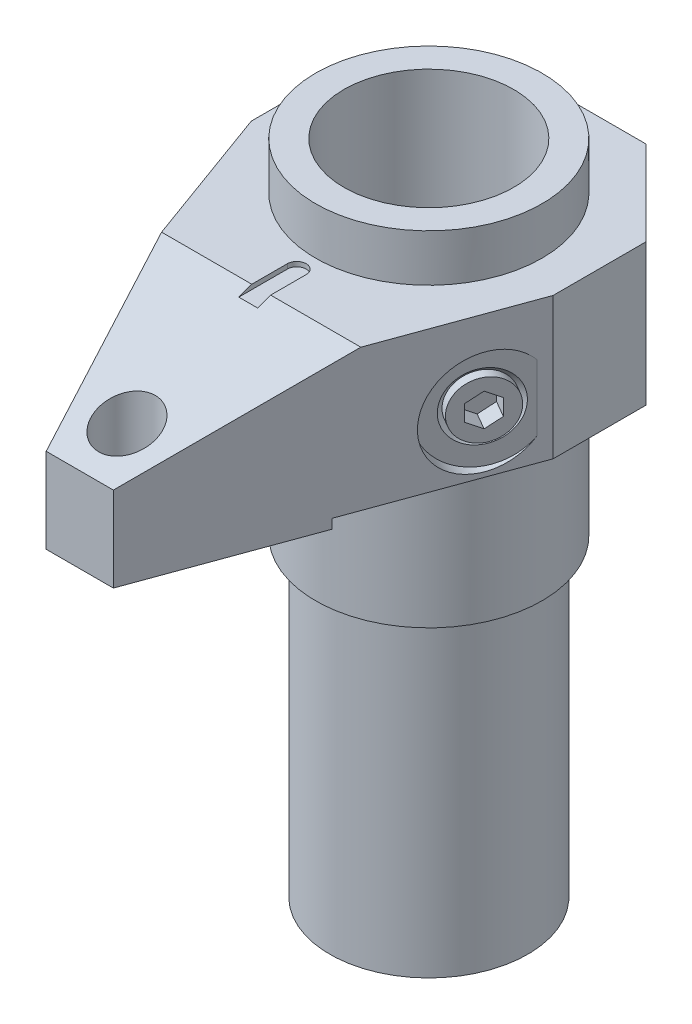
ISO-10303-21;
HEADER;
FILE_DESCRIPTION(('STEP AP214'),'2;1');
FILE_NAME('part.step','',(''),(''),'','','');
FILE_SCHEMA(('AUTOMOTIVE_DESIGN { 1 0 10303 214 1 1 1 1 }'));
ENDSEC;
DATA;
#1=APPLICATION_CONTEXT('core data for automotive mechanical design processes');
#2=APPLICATION_PROTOCOL_DEFINITION('international standard','automotive_design',2000,#1);
#3=PRODUCT_CONTEXT('',#1,'mechanical');
#4=PRODUCT('Part','Part','',(#3));
#5=PRODUCT_RELATED_PRODUCT_CATEGORY('part','',(#4));
#6=PRODUCT_DEFINITION_FORMATION('','',#4);
#7=PRODUCT_DEFINITION_CONTEXT('part definition',#1,'design');
#8=PRODUCT_DEFINITION('design','',#6,#7);
#9=PRODUCT_DEFINITION_SHAPE('','',#8);
#10=(LENGTH_UNIT() NAMED_UNIT(*) SI_UNIT(.MILLI.,.METRE.));
#11=(NAMED_UNIT(*) PLANE_ANGLE_UNIT() SI_UNIT($,.RADIAN.));
#12=(NAMED_UNIT(*) SI_UNIT($,.STERADIAN.) SOLID_ANGLE_UNIT());
#13=UNCERTAINTY_MEASURE_WITH_UNIT(LENGTH_MEASURE(1.E-05),#10,'distance_accuracy_value','');
#14=(GEOMETRIC_REPRESENTATION_CONTEXT(3) GLOBAL_UNCERTAINTY_ASSIGNED_CONTEXT((#13)) GLOBAL_UNIT_ASSIGNED_CONTEXT((#10,
#11,#12)) REPRESENTATION_CONTEXT('',''));
#15=CARTESIAN_POINT('',(0.,0.,0.));
#16=DIRECTION('',(0.,0.,1.));
#17=DIRECTION('',(1.,0.,0.));
#18=AXIS2_PLACEMENT_3D('',#15,#16,#17);
#19=CARTESIAN_POINT('',(0.,-13.05,0.));
#20=DIRECTION('',(0.,1.,0.));
#21=DIRECTION('',(1.,0.,0.));
#22=AXIS2_PLACEMENT_3D('',#19,#20,#21);
#23=PLANE('',#22);
#24=CARTESIAN_POINT('',(0.,-13.05,32.));
#25=DIRECTION('',(0.,-1.,0.));
#26=DIRECTION('',(0.,0.,-1.));
#27=AXIS2_PLACEMENT_3D('',#24,#25,#26);
#28=CIRCLE('',#27,3.);
#29=CARTESIAN_POINT('',(0.,-13.05,29.));
#30=VERTEX_POINT('',#29);
#31=EDGE_CURVE('E1205',#30,#30,#28,.T.);
#32=ORIENTED_EDGE('',*,*,#31,.F.);
#33=EDGE_LOOP('',(#32));
#34=FACE_BOUND('',#33,.T.);
#35=DIRECTION('',(-1.,0.,0.));
#36=VECTOR('',#35,1.);
#37=CARTESIAN_POINT('',(-3.55994569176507,-13.05,37.));
#38=LINE('',#37,#36);
#39=CARTESIAN_POINT('',(3.55994569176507,-13.05,37.));
#40=VERTEX_POINT('',#39);
#41=CARTESIAN_POINT('',(-3.55994569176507,-13.05,37.));
#42=VERTEX_POINT('',#41);
#43=EDGE_CURVE('E1059',#40,#42,#38,.T.);
#44=ORIENTED_EDGE('',*,*,#43,.T.);
#45=DIRECTION('',(-0.342020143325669,0.,-0.939692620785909));
#46=VECTOR('',#45,1.);
#47=CARTESIAN_POINT('',(-9.74743967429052,-13.05,20.));
#48=LINE('',#47,#46);
#49=CARTESIAN_POINT('',(-9.74743967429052,-13.05,20.));
#50=VERTEX_POINT('',#49);
#51=EDGE_CURVE('E1062',#42,#50,#48,.T.);
#52=ORIENTED_EDGE('',*,*,#51,.T.);
#53=DIRECTION('',(1.,0.,0.));
#54=VECTOR('',#53,1.);
#55=CARTESIAN_POINT('',(9.74743967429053,-13.05,20.));
#56=LINE('',#55,#54);
#57=CARTESIAN_POINT('',(9.74743967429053,-13.05,20.));
#58=VERTEX_POINT('',#57);
#59=EDGE_CURVE('E1064',#50,#58,#56,.T.);
#60=ORIENTED_EDGE('',*,*,#59,.T.);
#61=DIRECTION('',(-0.342020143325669,0.,0.939692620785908));
#62=VECTOR('',#61,1.);
#63=CARTESIAN_POINT('',(3.55994569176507,-13.05,37.));
#64=LINE('',#63,#62);
#65=EDGE_CURVE('E1066',#58,#40,#64,.T.);
#66=ORIENTED_EDGE('',*,*,#65,.T.);
#67=EDGE_LOOP('',(#44,#52,#60,#66));
#68=FACE_BOUND('',#67,.T.);
#69=ADVANCED_FACE('F17',(#34,#68),#23,.F.);
#70=CARTESIAN_POINT('',(0.,-49.2614463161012,0.));
#71=DIRECTION('',(0.,-1.,0.));
#72=DIRECTION('',(0.,0.,-1.));
#73=AXIS2_PLACEMENT_3D('',#70,#71,#72);
#74=CYLINDRICAL_SURFACE('',#73,12.);
#75=CARTESIAN_POINT('',(0.,-28.5,0.));
#76=DIRECTION('',(0.,-1.,0.));
#77=DIRECTION('',(0.,0.,-1.));
#78=AXIS2_PLACEMENT_3D('',#75,#76,#77);
#79=CIRCLE('',#78,12.);
#80=CARTESIAN_POINT('',(0.,-28.5,-12.));
#81=VERTEX_POINT('',#80);
#82=EDGE_CURVE('E254',#81,#81,#79,.T.);
#83=ORIENTED_EDGE('',*,*,#82,.F.);
#84=EDGE_LOOP('',(#83));
#85=FACE_BOUND('',#84,.T.);
#86=CARTESIAN_POINT('',(0.,-12.05,0.));
#87=DIRECTION('',(0.,-1.,0.));
#88=DIRECTION('',(-1.,0.,0.));
#89=AXIS2_PLACEMENT_3D('',#86,#87,#88);
#90=CIRCLE('',#89,12.);
#91=CARTESIAN_POINT('',(-12.,-12.05,0.));
#92=VERTEX_POINT('',#91);
#93=EDGE_CURVE('E1077',#92,#92,#90,.T.);
#94=ORIENTED_EDGE('',*,*,#93,.T.);
#95=EDGE_LOOP('',(#94));
#96=FACE_BOUND('',#95,.T.);
#97=ADVANCED_FACE('F298',(#85,#96),#74,.T.);
#98=CARTESIAN_POINT('',(0.,-49.2614463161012,0.));
#99=DIRECTION('',(0.,-1.,0.));
#100=DIRECTION('',(0.,0.,-1.));
#101=AXIS2_PLACEMENT_3D('',#98,#99,#100);
#102=CYLINDRICAL_SURFACE('',#101,10.5);
#103=CARTESIAN_POINT('',(0.,-29.3,0.));
#104=DIRECTION('',(0.,-1.,0.));
#105=DIRECTION('',(0.,0.,-1.));
#106=AXIS2_PLACEMENT_3D('',#103,#104,#105);
#107=CIRCLE('',#106,10.5);
#108=CARTESIAN_POINT('',(0.,-29.3,-10.5));
#109=VERTEX_POINT('',#108);
#110=EDGE_CURVE('E27',#109,#109,#107,.T.);
#111=ORIENTED_EDGE('',*,*,#110,.T.);
#112=EDGE_LOOP('',(#111));
#113=FACE_BOUND('',#112,.T.);
#114=CARTESIAN_POINT('',(0.,-61.7,0.));
#115=DIRECTION('',(0.,-1.,0.));
#116=DIRECTION('',(0.,0.,-1.));
#117=AXIS2_PLACEMENT_3D('',#114,#115,#116);
#118=CIRCLE('',#117,10.5);
#119=CARTESIAN_POINT('',(0.,-61.7,-10.5));
#120=VERTEX_POINT('',#119);
#121=EDGE_CURVE('E257',#120,#120,#118,.T.);
#122=ORIENTED_EDGE('',*,*,#121,.F.);
#123=EDGE_LOOP('',(#122));
#124=FACE_BOUND('',#123,.T.);
#125=ADVANCED_FACE('F270',(#113,#124),#102,.T.);
#126=CARTESIAN_POINT('',(10.5,-61.7,0.));
#127=DIRECTION('',(0.,-1.,0.));
#128=DIRECTION('',(0.,0.,-1.));
#129=AXIS2_PLACEMENT_3D('',#126,#127,#128);
#130=PLANE('',#129);
#131=ORIENTED_EDGE('',*,*,#121,.T.);
#132=EDGE_LOOP('',(#131));
#133=FACE_BOUND('',#132,.T.);
#134=ADVANCED_FACE('F288',(#133),#130,.T.);
#135=CARTESIAN_POINT('',(12.,-28.5,0.));
#136=DIRECTION('',(0.,-1.,0.));
#137=DIRECTION('',(0.,0.,-1.));
#138=AXIS2_PLACEMENT_3D('',#135,#136,#137);
#139=PLANE('',#138);
#140=CARTESIAN_POINT('',(0.,-28.5,0.));
#141=DIRECTION('',(0.,-1.,0.));
#142=DIRECTION('',(0.,0.,-1.));
#143=AXIS2_PLACEMENT_3D('',#140,#141,#142);
#144=CIRCLE('',#143,11.3);
#145=CARTESIAN_POINT('',(0.,-28.5,-11.3));
#146=VERTEX_POINT('',#145);
#147=EDGE_CURVE('E11',#146,#146,#144,.F.);
#148=ORIENTED_EDGE('',*,*,#147,.T.);
#149=EDGE_LOOP('',(#148));
#150=FACE_BOUND('',#149,.T.);
#151=ORIENTED_EDGE('',*,*,#82,.T.);
#152=EDGE_LOOP('',(#151));
#153=FACE_BOUND('',#152,.T.);
#154=ADVANCED_FACE('F275',(#150,#153),#139,.T.);
#155=CARTESIAN_POINT('',(0.,-29.3,0.));
#156=DIRECTION('',(0.,-1.,0.));
#157=DIRECTION('',(0.,0.,-1.));
#158=AXIS2_PLACEMENT_3D('',#155,#156,#157);
#159=TOROIDAL_SURFACE('',#158,11.3,0.8);
#160=ORIENTED_EDGE('',*,*,#147,.F.);
#161=EDGE_LOOP('',(#160));
#162=FACE_BOUND('',#161,.T.);
#163=ORIENTED_EDGE('',*,*,#110,.F.);
#164=EDGE_LOOP('',(#163));
#165=FACE_BOUND('',#164,.T.);
#166=ADVANCED_FACE('F19',(#162,#165),#159,.F.);
#167=CARTESIAN_POINT('',(-8.66025403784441,-6.05,5.));
#168=DIRECTION('',(0.86602540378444,0.,-0.5));
#169=DIRECTION('',(0.,1.,0.));
#170=AXIS2_PLACEMENT_3D('',#167,#168,#169);
#171=CYLINDRICAL_SURFACE('',#170,3.);
#172=CARTESIAN_POINT('',(-13.856406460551,-6.05,8.));
#173=DIRECTION('',(0.86602540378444,0.,-0.5));
#174=DIRECTION('',(0.,1.,0.));
#175=AXIS2_PLACEMENT_3D('',#172,#173,#174);
#176=CIRCLE('',#175,3.);
#177=CARTESIAN_POINT('',(-13.856406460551,-3.05,8.));
#178=VERTEX_POINT('',#177);
#179=EDGE_CURVE('E901',#178,#178,#176,.T.);
#180=ORIENTED_EDGE('',*,*,#179,.T.);
#181=EDGE_LOOP('',(#180));
#182=FACE_BOUND('',#181,.T.);
#183=CARTESIAN_POINT('',(-12.9903810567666,-6.05,7.5));
#184=DIRECTION('',(-0.86602540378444,0.,0.5));
#185=DIRECTION('',(0.5,0.,0.86602540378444));
#186=AXIS2_PLACEMENT_3D('',#183,#184,#185);
#187=CIRCLE('',#186,3.);
#188=CARTESIAN_POINT('',(-11.4903810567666,-6.05,10.0980762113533));
#189=VERTEX_POINT('',#188);
#190=EDGE_CURVE('E258',#189,#189,#187,.F.);
#191=ORIENTED_EDGE('',*,*,#190,.F.);
#192=EDGE_LOOP('',(#191));
#193=FACE_BOUND('',#192,.T.);
#194=ADVANCED_FACE('F274',(#182,#193),#171,.T.);
#195=CARTESIAN_POINT('',(-13.856406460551,-6.05,8.));
#196=DIRECTION('',(0.86602540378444,0.,-0.5));
#197=DIRECTION('',(0.,1.,0.));
#198=AXIS2_PLACEMENT_3D('',#195,#196,#197);
#199=PLANE('',#198);
#200=DIRECTION('',(-0.433012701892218,-0.5,-0.75));
#201=VECTOR('',#200,1.);
#202=CARTESIAN_POINT('',(-13.856406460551,-4.31794919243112,8.));
#203=LINE('',#202,#201);
#204=CARTESIAN_POINT('',(-13.856406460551,-4.31794919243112,8.));
#205=VERTEX_POINT('',#204);
#206=CARTESIAN_POINT('',(-14.606406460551,-5.18397459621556,6.70096189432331));
#207=VERTEX_POINT('',#206);
#208=EDGE_CURVE('E898',#205,#207,#203,.T.);
#209=ORIENTED_EDGE('',*,*,#208,.F.);
#210=DIRECTION('',(-0.433012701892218,0.5,-0.75));
#211=VECTOR('',#210,1.);
#212=CARTESIAN_POINT('',(-13.106406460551,-5.18397459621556,9.29903810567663));
#213=LINE('',#212,#211);
#214=CARTESIAN_POINT('',(-13.106406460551,-5.18397459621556,9.29903810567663));
#215=VERTEX_POINT('',#214);
#216=EDGE_CURVE('E35',#215,#205,#213,.T.);
#217=ORIENTED_EDGE('',*,*,#216,.F.);
#218=DIRECTION('',(0.,1.,0.));
#219=VECTOR('',#218,1.);
#220=CARTESIAN_POINT('',(-13.106406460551,-6.91602540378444,9.29903810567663));
#221=LINE('',#220,#219);
#222=CARTESIAN_POINT('',(-13.106406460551,-6.91602540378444,9.29903810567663));
#223=VERTEX_POINT('',#222);
#224=EDGE_CURVE('E1214',#223,#215,#221,.T.);
#225=ORIENTED_EDGE('',*,*,#224,.F.);
#226=DIRECTION('',(0.433012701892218,0.5,0.75));
#227=VECTOR('',#226,1.);
#228=CARTESIAN_POINT('',(-13.856406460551,-7.78205080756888,8.));
#229=LINE('',#228,#227);
#230=CARTESIAN_POINT('',(-13.856406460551,-7.78205080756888,8.));
#231=VERTEX_POINT('',#230);
#232=EDGE_CURVE('E1237',#231,#223,#229,.T.);
#233=ORIENTED_EDGE('',*,*,#232,.F.);
#234=DIRECTION('',(0.433012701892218,-0.5,0.75));
#235=VECTOR('',#234,1.);
#236=CARTESIAN_POINT('',(-14.606406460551,-6.91602540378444,6.70096189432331));
#237=LINE('',#236,#235);
#238=CARTESIAN_POINT('',(-14.606406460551,-6.91602540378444,6.70096189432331));
#239=VERTEX_POINT('',#238);
#240=EDGE_CURVE('E1234',#239,#231,#237,.T.);
#241=ORIENTED_EDGE('',*,*,#240,.F.);
#242=DIRECTION('',(0.,-1.,0.));
#243=VECTOR('',#242,1.);
#244=CARTESIAN_POINT('',(-14.606406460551,-5.18397459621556,6.70096189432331));
#245=LINE('',#244,#243);
#246=EDGE_CURVE('E1231',#207,#239,#245,.T.);
#247=ORIENTED_EDGE('',*,*,#246,.F.);
#248=EDGE_LOOP('',(#209,#217,#225,#233,#241,#247));
#249=FACE_BOUND('',#248,.T.);
#250=ORIENTED_EDGE('',*,*,#179,.F.);
#251=EDGE_LOOP('',(#250));
#252=FACE_BOUND('',#251,.T.);
#253=ADVANCED_FACE('F284',(#249,#252),#199,.F.);
#254=CARTESIAN_POINT('',(-11.3743556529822,-5.18397459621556,8.29903810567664));
#255=DIRECTION('',(0.25,0.866025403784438,0.433012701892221));
#256=DIRECTION('',(-0.433012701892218,0.5,-0.75));
#257=AXIS2_PLACEMENT_3D('',#254,#255,#256);
#258=PLANE('',#257);
#259=ORIENTED_EDGE('',*,*,#216,.T.);
#260=DIRECTION('',(-0.86602540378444,0.,0.5));
#261=VECTOR('',#260,1.);
#262=CARTESIAN_POINT('',(-12.1243556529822,-4.31794919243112,7.));
#263=LINE('',#262,#261);
#264=CARTESIAN_POINT('',(-12.1243556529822,-4.31794919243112,7.));
#265=VERTEX_POINT('',#264);
#266=EDGE_CURVE('E909',#265,#205,#263,.T.);
#267=ORIENTED_EDGE('',*,*,#266,.F.);
#268=DIRECTION('',(-0.433012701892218,0.5,-0.75));
#269=VECTOR('',#268,1.);
#270=CARTESIAN_POINT('',(-11.3743556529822,-5.18397459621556,8.29903810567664));
#271=LINE('',#270,#269);
#272=CARTESIAN_POINT('',(-11.3743556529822,-5.18397459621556,8.29903810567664));
#273=VERTEX_POINT('',#272);
#274=EDGE_CURVE('E1210',#273,#265,#271,.T.);
#275=ORIENTED_EDGE('',*,*,#274,.F.);
#276=DIRECTION('',(-0.86602540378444,0.,0.5));
#277=VECTOR('',#276,1.);
#278=CARTESIAN_POINT('',(-11.3743556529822,-5.18397459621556,8.29903810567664));
#279=LINE('',#278,#277);
#280=EDGE_CURVE('E902',#273,#215,#279,.T.);
#281=ORIENTED_EDGE('',*,*,#280,.T.);
#282=EDGE_LOOP('',(#259,#267,#275,#281));
#283=FACE_BOUND('',#282,.T.);
#284=ADVANCED_FACE('F844',(#283),#258,.F.);
#285=CARTESIAN_POINT('',(-11.3743556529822,-6.91602540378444,8.29903810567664));
#286=DIRECTION('',(0.5,0.,0.86602540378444));
#287=DIRECTION('',(0.,1.,0.));
#288=AXIS2_PLACEMENT_3D('',#285,#286,#287);
#289=PLANE('',#288);
#290=ORIENTED_EDGE('',*,*,#224,.T.);
#291=ORIENTED_EDGE('',*,*,#280,.F.);
#292=DIRECTION('',(0.,1.,0.));
#293=VECTOR('',#292,1.);
#294=CARTESIAN_POINT('',(-11.3743556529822,-6.91602540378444,8.29903810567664));
#295=LINE('',#294,#293);
#296=CARTESIAN_POINT('',(-11.3743556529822,-6.91602540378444,8.29903810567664));
#297=VERTEX_POINT('',#296);
#298=EDGE_CURVE('E1226',#297,#273,#295,.T.);
#299=ORIENTED_EDGE('',*,*,#298,.F.);
#300=DIRECTION('',(-0.86602540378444,0.,0.5));
#301=VECTOR('',#300,1.);
#302=CARTESIAN_POINT('',(-11.3743556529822,-6.91602540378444,8.29903810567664));
#303=LINE('',#302,#301);
#304=EDGE_CURVE('E906',#297,#223,#303,.T.);
#305=ORIENTED_EDGE('',*,*,#304,.T.);
#306=EDGE_LOOP('',(#290,#291,#299,#305));
#307=FACE_BOUND('',#306,.T.);
#308=ADVANCED_FACE('F835',(#307),#289,.F.);
#309=CARTESIAN_POINT('',(-12.1243556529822,-7.78205080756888,7.));
#310=DIRECTION('',(0.25,-0.866025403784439,0.43301270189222));
#311=DIRECTION('',(0.433012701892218,0.5,0.75));
#312=AXIS2_PLACEMENT_3D('',#309,#310,#311);
#313=PLANE('',#312);
#314=ORIENTED_EDGE('',*,*,#232,.T.);
#315=ORIENTED_EDGE('',*,*,#304,.F.);
#316=DIRECTION('',(0.433012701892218,0.5,0.75));
#317=VECTOR('',#316,1.);
#318=CARTESIAN_POINT('',(-12.1243556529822,-7.78205080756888,7.));
#319=LINE('',#318,#317);
#320=CARTESIAN_POINT('',(-12.1243556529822,-7.78205080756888,7.));
#321=VERTEX_POINT('',#320);
#322=EDGE_CURVE('E1223',#321,#297,#319,.T.);
#323=ORIENTED_EDGE('',*,*,#322,.F.);
#324=DIRECTION('',(-0.86602540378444,0.,0.5));
#325=VECTOR('',#324,1.);
#326=CARTESIAN_POINT('',(-12.1243556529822,-7.78205080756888,7.));
#327=LINE('',#326,#325);
#328=EDGE_CURVE('E1244',#321,#231,#327,.T.);
#329=ORIENTED_EDGE('',*,*,#328,.T.);
#330=EDGE_LOOP('',(#314,#315,#323,#329));
#331=FACE_BOUND('',#330,.T.);
#332=ADVANCED_FACE('F826',(#331),#313,.F.);
#333=CARTESIAN_POINT('',(-12.8743556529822,-6.91602540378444,5.70096189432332));
#334=DIRECTION('',(-0.25,-0.866025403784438,-0.433012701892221));
#335=DIRECTION('',(0.433012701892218,-0.5,0.75));
#336=AXIS2_PLACEMENT_3D('',#333,#334,#335);
#337=PLANE('',#336);
#338=ORIENTED_EDGE('',*,*,#240,.T.);
#339=ORIENTED_EDGE('',*,*,#328,.F.);
#340=DIRECTION('',(0.433012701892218,-0.5,0.75));
#341=VECTOR('',#340,1.);
#342=CARTESIAN_POINT('',(-12.8743556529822,-6.91602540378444,5.70096189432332));
#343=LINE('',#342,#341);
#344=CARTESIAN_POINT('',(-12.8743556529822,-6.91602540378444,5.70096189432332));
#345=VERTEX_POINT('',#344);
#346=EDGE_CURVE('E1220',#345,#321,#343,.T.);
#347=ORIENTED_EDGE('',*,*,#346,.F.);
#348=DIRECTION('',(-0.86602540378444,0.,0.5));
#349=VECTOR('',#348,1.);
#350=CARTESIAN_POINT('',(-12.8743556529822,-6.91602540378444,5.70096189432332));
#351=LINE('',#350,#349);
#352=EDGE_CURVE('E1247',#345,#239,#351,.T.);
#353=ORIENTED_EDGE('',*,*,#352,.T.);
#354=EDGE_LOOP('',(#338,#339,#347,#353));
#355=FACE_BOUND('',#354,.T.);
#356=ADVANCED_FACE('F817',(#355),#337,.F.);
#357=CARTESIAN_POINT('',(-12.8743556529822,-5.18397459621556,5.70096189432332));
#358=DIRECTION('',(-0.5,0.,-0.86602540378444));
#359=DIRECTION('',(0.,-1.,0.));
#360=AXIS2_PLACEMENT_3D('',#357,#358,#359);
#361=PLANE('',#360);
#362=ORIENTED_EDGE('',*,*,#246,.T.);
#363=ORIENTED_EDGE('',*,*,#352,.F.);
#364=DIRECTION('',(0.,-1.,0.));
#365=VECTOR('',#364,1.);
#366=CARTESIAN_POINT('',(-12.8743556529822,-5.18397459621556,5.70096189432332));
#367=LINE('',#366,#365);
#368=CARTESIAN_POINT('',(-12.8743556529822,-5.18397459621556,5.70096189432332));
#369=VERTEX_POINT('',#368);
#370=EDGE_CURVE('E1217',#369,#345,#367,.T.);
#371=ORIENTED_EDGE('',*,*,#370,.F.);
#372=DIRECTION('',(-0.86602540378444,0.,0.5));
#373=VECTOR('',#372,1.);
#374=CARTESIAN_POINT('',(-12.8743556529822,-5.18397459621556,5.70096189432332));
#375=LINE('',#374,#373);
#376=EDGE_CURVE('E1249',#369,#207,#375,.T.);
#377=ORIENTED_EDGE('',*,*,#376,.T.);
#378=EDGE_LOOP('',(#362,#363,#371,#377));
#379=FACE_BOUND('',#378,.T.);
#380=ADVANCED_FACE('F808',(#379),#361,.F.);
#381=CARTESIAN_POINT('',(-12.1243556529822,-4.31794919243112,7.));
#382=DIRECTION('',(-0.25,0.866025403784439,-0.43301270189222));
#383=DIRECTION('',(-0.433012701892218,-0.5,-0.75));
#384=AXIS2_PLACEMENT_3D('',#381,#382,#383);
#385=PLANE('',#384);
#386=ORIENTED_EDGE('',*,*,#208,.T.);
#387=ORIENTED_EDGE('',*,*,#376,.F.);
#388=DIRECTION('',(-0.433012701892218,-0.5,-0.75));
#389=VECTOR('',#388,1.);
#390=CARTESIAN_POINT('',(-12.1243556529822,-4.31794919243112,7.));
#391=LINE('',#390,#389);
#392=EDGE_CURVE('E1213',#265,#369,#391,.T.);
#393=ORIENTED_EDGE('',*,*,#392,.F.);
#394=ORIENTED_EDGE('',*,*,#266,.T.);
#395=EDGE_LOOP('',(#386,#387,#393,#394));
#396=FACE_BOUND('',#395,.T.);
#397=ADVANCED_FACE('F800',(#396),#385,.F.);
#398=CARTESIAN_POINT('',(-12.1243556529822,-6.05,7.));
#399=DIRECTION('',(-0.86602540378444,0.,0.5));
#400=DIRECTION('',(0.,-1.,0.));
#401=AXIS2_PLACEMENT_3D('',#398,#399,#400);
#402=PLANE('',#401);
#403=ORIENTED_EDGE('',*,*,#274,.T.);
#404=ORIENTED_EDGE('',*,*,#392,.T.);
#405=ORIENTED_EDGE('',*,*,#370,.T.);
#406=ORIENTED_EDGE('',*,*,#346,.T.);
#407=ORIENTED_EDGE('',*,*,#322,.T.);
#408=ORIENTED_EDGE('',*,*,#298,.T.);
#409=EDGE_LOOP('',(#403,#404,#405,#406,#407,#408));
#410=FACE_BOUND('',#409,.T.);
#411=ADVANCED_FACE('F294',(#410),#402,.T.);
#412=CARTESIAN_POINT('',(12.1243556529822,-6.05,7.));
#413=DIRECTION('',(0.86602540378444,0.,0.5));
#414=DIRECTION('',(0.,-1.,0.));
#415=AXIS2_PLACEMENT_3D('',#412,#413,#414);
#416=PLANE('',#415);
#417=DIRECTION('',(-0.433012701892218,0.5,0.75));
#418=VECTOR('',#417,1.);
#419=CARTESIAN_POINT('',(12.8743556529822,-5.18397459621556,5.70096189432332));
#420=LINE('',#419,#418);
#421=CARTESIAN_POINT('',(12.8743556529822,-5.18397459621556,5.70096189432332));
#422=VERTEX_POINT('',#421);
#423=CARTESIAN_POINT('',(12.1243556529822,-4.31794919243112,7.));
#424=VERTEX_POINT('',#423);
#425=EDGE_CURVE('E912',#422,#424,#420,.T.);
#426=ORIENTED_EDGE('',*,*,#425,.T.);
#427=DIRECTION('',(-0.433012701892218,-0.5,0.75));
#428=VECTOR('',#427,1.);
#429=CARTESIAN_POINT('',(12.1243556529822,-4.31794919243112,7.));
#430=LINE('',#429,#428);
#431=CARTESIAN_POINT('',(11.3743556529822,-5.18397459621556,8.29903810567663));
#432=VERTEX_POINT('',#431);
#433=EDGE_CURVE('E915',#424,#432,#430,.T.);
#434=ORIENTED_EDGE('',*,*,#433,.T.);
#435=DIRECTION('',(0.,-1.,0.));
#436=VECTOR('',#435,1.);
#437=CARTESIAN_POINT('',(11.3743556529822,-5.18397459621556,8.29903810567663));
#438=LINE('',#437,#436);
#439=CARTESIAN_POINT('',(11.3743556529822,-6.91602540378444,8.29903810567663));
#440=VERTEX_POINT('',#439);
#441=EDGE_CURVE('E919',#432,#440,#438,.T.);
#442=ORIENTED_EDGE('',*,*,#441,.T.);
#443=DIRECTION('',(0.433012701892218,-0.5,-0.75));
#444=VECTOR('',#443,1.);
#445=CARTESIAN_POINT('',(11.3743556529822,-6.91602540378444,8.29903810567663));
#446=LINE('',#445,#444);
#447=CARTESIAN_POINT('',(12.1243556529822,-7.78205080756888,7.));
#448=VERTEX_POINT('',#447);
#449=EDGE_CURVE('E922',#440,#448,#446,.T.);
#450=ORIENTED_EDGE('',*,*,#449,.T.);
#451=DIRECTION('',(0.433012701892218,0.5,-0.75));
#452=VECTOR('',#451,1.);
#453=CARTESIAN_POINT('',(12.1243556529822,-7.78205080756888,7.));
#454=LINE('',#453,#452);
#455=CARTESIAN_POINT('',(12.8743556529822,-6.91602540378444,5.70096189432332));
#456=VERTEX_POINT('',#455);
#457=EDGE_CURVE('E925',#448,#456,#454,.T.);
#458=ORIENTED_EDGE('',*,*,#457,.T.);
#459=DIRECTION('',(0.,1.,0.));
#460=VECTOR('',#459,1.);
#461=CARTESIAN_POINT('',(12.8743556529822,-6.91602540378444,5.70096189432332));
#462=LINE('',#461,#460);
#463=EDGE_CURVE('E928',#456,#422,#462,.T.);
#464=ORIENTED_EDGE('',*,*,#463,.T.);
#465=EDGE_LOOP('',(#426,#434,#442,#450,#458,#464));
#466=FACE_BOUND('',#465,.T.);
#467=ADVANCED_FACE('F277',(#466),#416,.T.);
#468=CARTESIAN_POINT('',(11.3743556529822,-5.18397459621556,8.29903810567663));
#469=DIRECTION('',(-0.5,0.,0.86602540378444));
#470=DIRECTION('',(0.,-1.,0.));
#471=AXIS2_PLACEMENT_3D('',#468,#469,#470);
#472=PLANE('',#471);
#473=DIRECTION('',(0.,-1.,0.));
#474=VECTOR('',#473,1.);
#475=CARTESIAN_POINT('',(13.106406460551,-5.18397459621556,9.29903810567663));
#476=LINE('',#475,#474);
#477=CARTESIAN_POINT('',(13.106406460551,-5.18397459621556,9.29903810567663));
#478=VERTEX_POINT('',#477);
#479=CARTESIAN_POINT('',(13.106406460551,-6.91602540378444,9.29903810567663));
#480=VERTEX_POINT('',#479);
#481=EDGE_CURVE('E938',#478,#480,#476,.T.);
#482=ORIENTED_EDGE('',*,*,#481,.T.);
#483=DIRECTION('',(0.86602540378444,0.,0.5));
#484=VECTOR('',#483,1.);
#485=CARTESIAN_POINT('',(11.3743556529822,-6.91602540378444,8.29903810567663));
#486=LINE('',#485,#484);
#487=EDGE_CURVE('E956',#440,#480,#486,.T.);
#488=ORIENTED_EDGE('',*,*,#487,.F.);
#489=ORIENTED_EDGE('',*,*,#441,.F.);
#490=DIRECTION('',(0.86602540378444,0.,0.5));
#491=VECTOR('',#490,1.);
#492=CARTESIAN_POINT('',(11.3743556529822,-5.18397459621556,8.29903810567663));
#493=LINE('',#492,#491);
#494=EDGE_CURVE('E958',#432,#478,#493,.T.);
#495=ORIENTED_EDGE('',*,*,#494,.T.);
#496=EDGE_LOOP('',(#482,#488,#489,#495));
#497=FACE_BOUND('',#496,.T.);
#498=ADVANCED_FACE('F293',(#497),#472,.F.);
#499=CARTESIAN_POINT('',(11.3743556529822,-6.91602540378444,8.29903810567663));
#500=DIRECTION('',(-0.25,-0.866025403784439,0.43301270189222));
#501=DIRECTION('',(0.433012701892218,-0.5,-0.75));
#502=AXIS2_PLACEMENT_3D('',#499,#500,#501);
#503=PLANE('',#502);
#504=DIRECTION('',(0.433012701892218,-0.5,-0.75));
#505=VECTOR('',#504,1.);
#506=CARTESIAN_POINT('',(13.106406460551,-6.91602540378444,9.29903810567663));
#507=LINE('',#506,#505);
#508=CARTESIAN_POINT('',(13.856406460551,-7.78205080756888,8.));
#509=VERTEX_POINT('',#508);
#510=EDGE_CURVE('E941',#480,#509,#507,.T.);
#511=ORIENTED_EDGE('',*,*,#510,.T.);
#512=DIRECTION('',(0.86602540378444,0.,0.5));
#513=VECTOR('',#512,1.);
#514=CARTESIAN_POINT('',(12.1243556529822,-7.78205080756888,7.));
#515=LINE('',#514,#513);
#516=EDGE_CURVE('E954',#448,#509,#515,.T.);
#517=ORIENTED_EDGE('',*,*,#516,.F.);
#518=ORIENTED_EDGE('',*,*,#449,.F.);
#519=ORIENTED_EDGE('',*,*,#487,.T.);
#520=EDGE_LOOP('',(#511,#517,#518,#519));
#521=FACE_BOUND('',#520,.T.);
#522=ADVANCED_FACE('F533',(#521),#503,.F.);
#523=CARTESIAN_POINT('',(12.1243556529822,-7.78205080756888,7.));
#524=DIRECTION('',(0.25,-0.866025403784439,-0.43301270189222));
#525=DIRECTION('',(0.433012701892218,0.5,-0.75));
#526=AXIS2_PLACEMENT_3D('',#523,#524,#525);
#527=PLANE('',#526);
#528=DIRECTION('',(0.433012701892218,0.5,-0.75));
#529=VECTOR('',#528,1.);
#530=CARTESIAN_POINT('',(13.856406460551,-7.78205080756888,8.));
#531=LINE('',#530,#529);
#532=CARTESIAN_POINT('',(14.606406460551,-6.91602540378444,6.70096189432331));
#533=VERTEX_POINT('',#532);
#534=EDGE_CURVE('E944',#509,#533,#531,.T.);
#535=ORIENTED_EDGE('',*,*,#534,.T.);
#536=DIRECTION('',(0.86602540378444,0.,0.5));
#537=VECTOR('',#536,1.);
#538=CARTESIAN_POINT('',(12.8743556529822,-6.91602540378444,5.70096189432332));
#539=LINE('',#538,#537);
#540=EDGE_CURVE('E952',#456,#533,#539,.T.);
#541=ORIENTED_EDGE('',*,*,#540,.F.);
#542=ORIENTED_EDGE('',*,*,#457,.F.);
#543=ORIENTED_EDGE('',*,*,#516,.T.);
#544=EDGE_LOOP('',(#535,#541,#542,#543));
#545=FACE_BOUND('',#544,.T.);
#546=ADVANCED_FACE('F542',(#545),#527,.F.);
#547=CARTESIAN_POINT('',(12.8743556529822,-6.91602540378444,5.70096189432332));
#548=DIRECTION('',(0.5,0.,-0.86602540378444));
#549=DIRECTION('',(0.,1.,0.));
#550=AXIS2_PLACEMENT_3D('',#547,#548,#549);
#551=PLANE('',#550);
#552=DIRECTION('',(0.,1.,0.));
#553=VECTOR('',#552,1.);
#554=CARTESIAN_POINT('',(14.606406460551,-6.91602540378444,6.70096189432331));
#555=LINE('',#554,#553);
#556=CARTESIAN_POINT('',(14.606406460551,-5.18397459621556,6.70096189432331));
#557=VERTEX_POINT('',#556);
#558=EDGE_CURVE('E916',#533,#557,#555,.T.);
#559=ORIENTED_EDGE('',*,*,#558,.T.);
#560=DIRECTION('',(0.86602540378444,0.,0.5));
#561=VECTOR('',#560,1.);
#562=CARTESIAN_POINT('',(12.8743556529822,-5.18397459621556,5.70096189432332));
#563=LINE('',#562,#561);
#564=EDGE_CURVE('E949',#422,#557,#563,.T.);
#565=ORIENTED_EDGE('',*,*,#564,.F.);
#566=ORIENTED_EDGE('',*,*,#463,.F.);
#567=ORIENTED_EDGE('',*,*,#540,.T.);
#568=EDGE_LOOP('',(#559,#565,#566,#567));
#569=FACE_BOUND('',#568,.T.);
#570=ADVANCED_FACE('F550',(#569),#551,.F.);
#571=CARTESIAN_POINT('',(12.8743556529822,-5.18397459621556,5.70096189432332));
#572=DIRECTION('',(0.25,0.866025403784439,-0.43301270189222));
#573=DIRECTION('',(-0.433012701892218,0.5,0.75));
#574=AXIS2_PLACEMENT_3D('',#571,#572,#573);
#575=PLANE('',#574);
#576=DIRECTION('',(-0.433012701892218,0.5,0.75));
#577=VECTOR('',#576,1.);
#578=CARTESIAN_POINT('',(14.606406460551,-5.18397459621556,6.70096189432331));
#579=LINE('',#578,#577);
#580=CARTESIAN_POINT('',(13.856406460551,-4.31794919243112,8.));
#581=VERTEX_POINT('',#580);
#582=EDGE_CURVE('E932',#557,#581,#579,.T.);
#583=ORIENTED_EDGE('',*,*,#582,.T.);
#584=DIRECTION('',(0.86602540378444,0.,0.5));
#585=VECTOR('',#584,1.);
#586=CARTESIAN_POINT('',(12.1243556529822,-4.31794919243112,7.));
#587=LINE('',#586,#585);
#588=EDGE_CURVE('E931',#424,#581,#587,.T.);
#589=ORIENTED_EDGE('',*,*,#588,.F.);
#590=ORIENTED_EDGE('',*,*,#425,.F.);
#591=ORIENTED_EDGE('',*,*,#564,.T.);
#592=EDGE_LOOP('',(#583,#589,#590,#591));
#593=FACE_BOUND('',#592,.T.);
#594=ADVANCED_FACE('F558',(#593),#575,.F.);
#595=CARTESIAN_POINT('',(12.1243556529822,-4.31794919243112,7.));
#596=DIRECTION('',(-0.25,0.866025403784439,0.43301270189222));
#597=DIRECTION('',(-0.433012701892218,-0.5,0.75));
#598=AXIS2_PLACEMENT_3D('',#595,#596,#597);
#599=PLANE('',#598);
#600=DIRECTION('',(-0.433012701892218,-0.5,0.75));
#601=VECTOR('',#600,1.);
#602=CARTESIAN_POINT('',(13.856406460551,-4.31794919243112,8.));
#603=LINE('',#602,#601);
#604=EDGE_CURVE('E934',#581,#478,#603,.T.);
#605=ORIENTED_EDGE('',*,*,#604,.T.);
#606=ORIENTED_EDGE('',*,*,#494,.F.);
#607=ORIENTED_EDGE('',*,*,#433,.F.);
#608=ORIENTED_EDGE('',*,*,#588,.T.);
#609=EDGE_LOOP('',(#605,#606,#607,#608));
#610=FACE_BOUND('',#609,.T.);
#611=ADVANCED_FACE('F566',(#610),#599,.F.);
#612=CARTESIAN_POINT('',(0.,-6.05,-14.));
#613=DIRECTION('',(0.,0.,-1.));
#614=DIRECTION('',(0.,1.,0.));
#615=AXIS2_PLACEMENT_3D('',#612,#613,#614);
#616=PLANE('',#615);
#617=DIRECTION('',(-0.866025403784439,-0.5,0.));
#618=VECTOR('',#617,1.);
#619=CARTESIAN_POINT('',(1.49999999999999,-6.91602540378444,-14.));
#620=LINE('',#619,#618);
#621=CARTESIAN_POINT('',(1.49999999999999,-6.91602540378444,-14.));
#622=VERTEX_POINT('',#621);
#623=CARTESIAN_POINT('',(0.,-7.78205080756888,-14.));
#624=VERTEX_POINT('',#623);
#625=EDGE_CURVE('E967',#622,#624,#620,.T.);
#626=ORIENTED_EDGE('',*,*,#625,.T.);
#627=DIRECTION('',(-0.866025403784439,0.5,0.));
#628=VECTOR('',#627,1.);
#629=CARTESIAN_POINT('',(0.,-7.78205080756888,-14.));
#630=LINE('',#629,#628);
#631=CARTESIAN_POINT('',(-1.5,-6.91602540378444,-14.));
#632=VERTEX_POINT('',#631);
#633=EDGE_CURVE('E970',#624,#632,#630,.T.);
#634=ORIENTED_EDGE('',*,*,#633,.T.);
#635=DIRECTION('',(0.,1.,0.));
#636=VECTOR('',#635,1.);
#637=CARTESIAN_POINT('',(-1.5,-6.91602540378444,-14.));
#638=LINE('',#637,#636);
#639=CARTESIAN_POINT('',(-1.5,-5.18397459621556,-14.));
#640=VERTEX_POINT('',#639);
#641=EDGE_CURVE('E974',#632,#640,#638,.T.);
#642=ORIENTED_EDGE('',*,*,#641,.T.);
#643=DIRECTION('',(0.866025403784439,0.5,0.));
#644=VECTOR('',#643,1.);
#645=CARTESIAN_POINT('',(-1.5,-5.18397459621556,-14.));
#646=LINE('',#645,#644);
#647=CARTESIAN_POINT('',(0.,-4.31794919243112,-14.));
#648=VERTEX_POINT('',#647);
#649=EDGE_CURVE('E977',#640,#648,#646,.T.);
#650=ORIENTED_EDGE('',*,*,#649,.T.);
#651=DIRECTION('',(0.866025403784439,-0.5,0.));
#652=VECTOR('',#651,1.);
#653=CARTESIAN_POINT('',(0.,-4.31794919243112,-14.));
#654=LINE('',#653,#652);
#655=CARTESIAN_POINT('',(1.49999999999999,-5.18397459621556,-14.));
#656=VERTEX_POINT('',#655);
#657=EDGE_CURVE('E980',#648,#656,#654,.T.);
#658=ORIENTED_EDGE('',*,*,#657,.T.);
#659=DIRECTION('',(0.,-1.,0.));
#660=VECTOR('',#659,1.);
#661=CARTESIAN_POINT('',(1.49999999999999,-5.18397459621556,-14.));
#662=LINE('',#661,#660);
#663=EDGE_CURVE('E983',#656,#622,#662,.T.);
#664=ORIENTED_EDGE('',*,*,#663,.T.);
#665=EDGE_LOOP('',(#626,#634,#642,#650,#658,#664));
#666=FACE_BOUND('',#665,.T.);
#667=ADVANCED_FACE('F574',(#666),#616,.T.);
#668=CARTESIAN_POINT('',(13.856406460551,-6.05,8.));
#669=DIRECTION('',(-0.86602540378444,0.,-0.5));
#670=DIRECTION('',(0.,1.,0.));
#671=AXIS2_PLACEMENT_3D('',#668,#669,#670);
#672=PLANE('',#671);
#673=ORIENTED_EDGE('',*,*,#604,.F.);
#674=ORIENTED_EDGE('',*,*,#582,.F.);
#675=ORIENTED_EDGE('',*,*,#558,.F.);
#676=ORIENTED_EDGE('',*,*,#534,.F.);
#677=ORIENTED_EDGE('',*,*,#510,.F.);
#678=ORIENTED_EDGE('',*,*,#481,.F.);
#679=EDGE_LOOP('',(#673,#674,#675,#676,#677,#678));
#680=FACE_BOUND('',#679,.T.);
#681=CARTESIAN_POINT('',(13.856406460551,-6.05,8.));
#682=DIRECTION('',(-0.86602540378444,0.,-0.5));
#683=DIRECTION('',(0.,1.,0.));
#684=AXIS2_PLACEMENT_3D('',#681,#682,#683);
#685=CIRCLE('',#684,3.);
#686=CARTESIAN_POINT('',(13.856406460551,-3.05,8.));
#687=VERTEX_POINT('',#686);
#688=EDGE_CURVE('E951',#687,#687,#685,.T.);
#689=ORIENTED_EDGE('',*,*,#688,.F.);
#690=EDGE_LOOP('',(#689));
#691=FACE_BOUND('',#690,.T.);
#692=ADVANCED_FACE('F582',(#680,#691),#672,.F.);
#693=CARTESIAN_POINT('',(-1.5,-6.91602540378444,-14.));
#694=DIRECTION('',(-1.,0.,0.));
#695=DIRECTION('',(0.,1.,0.));
#696=AXIS2_PLACEMENT_3D('',#693,#694,#695);
#697=PLANE('',#696);
#698=DIRECTION('',(0.,1.,0.));
#699=VECTOR('',#698,1.);
#700=CARTESIAN_POINT('',(-1.5,-6.91602540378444,-16.));
#701=LINE('',#700,#699);
#702=CARTESIAN_POINT('',(-1.5,-6.91602540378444,-16.));
#703=VERTEX_POINT('',#702);
#704=CARTESIAN_POINT('',(-1.5,-5.18397459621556,-16.));
#705=VERTEX_POINT('',#704);
#706=EDGE_CURVE('E991',#703,#705,#701,.T.);
#707=ORIENTED_EDGE('',*,*,#706,.T.);
#708=DIRECTION('',(0.,0.,-1.));
#709=VECTOR('',#708,1.);
#710=CARTESIAN_POINT('',(-1.5,-5.18397459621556,-14.));
#711=LINE('',#710,#709);
#712=EDGE_CURVE('E1009',#640,#705,#711,.T.);
#713=ORIENTED_EDGE('',*,*,#712,.F.);
#714=ORIENTED_EDGE('',*,*,#641,.F.);
#715=DIRECTION('',(0.,0.,-1.));
#716=VECTOR('',#715,1.);
#717=CARTESIAN_POINT('',(-1.5,-6.91602540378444,-14.));
#718=LINE('',#717,#716);
#719=EDGE_CURVE('E1011',#632,#703,#718,.T.);
#720=ORIENTED_EDGE('',*,*,#719,.T.);
#721=EDGE_LOOP('',(#707,#713,#714,#720));
#722=FACE_BOUND('',#721,.T.);
#723=ADVANCED_FACE('F590',(#722),#697,.F.);
#724=CARTESIAN_POINT('',(-1.5,-5.18397459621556,-14.));
#725=DIRECTION('',(-0.5,0.866025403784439,0.));
#726=DIRECTION('',(0.866025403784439,0.5,0.));
#727=AXIS2_PLACEMENT_3D('',#724,#725,#726);
#728=PLANE('',#727);
#729=DIRECTION('',(0.866025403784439,0.5,0.));
#730=VECTOR('',#729,1.);
#731=CARTESIAN_POINT('',(-1.5,-5.18397459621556,-16.));
#732=LINE('',#731,#730);
#733=CARTESIAN_POINT('',(0.,-4.31794919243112,-16.));
#734=VERTEX_POINT('',#733);
#735=EDGE_CURVE('E994',#705,#734,#732,.T.);
#736=ORIENTED_EDGE('',*,*,#735,.T.);
#737=DIRECTION('',(0.,0.,-1.));
#738=VECTOR('',#737,1.);
#739=CARTESIAN_POINT('',(0.,-4.31794919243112,-14.));
#740=LINE('',#739,#738);
#741=EDGE_CURVE('E1007',#648,#734,#740,.T.);
#742=ORIENTED_EDGE('',*,*,#741,.F.);
#743=ORIENTED_EDGE('',*,*,#649,.F.);
#744=ORIENTED_EDGE('',*,*,#712,.T.);
#745=EDGE_LOOP('',(#736,#742,#743,#744));
#746=FACE_BOUND('',#745,.T.);
#747=ADVANCED_FACE('F598',(#746),#728,.F.);
#748=CARTESIAN_POINT('',(0.,-4.31794919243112,-14.));
#749=DIRECTION('',(0.5,0.866025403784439,0.));
#750=DIRECTION('',(0.866025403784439,-0.5,0.));
#751=AXIS2_PLACEMENT_3D('',#748,#749,#750);
#752=PLANE('',#751);
#753=DIRECTION('',(0.866025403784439,-0.5,0.));
#754=VECTOR('',#753,1.);
#755=CARTESIAN_POINT('',(0.,-4.31794919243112,-16.));
#756=LINE('',#755,#754);
#757=CARTESIAN_POINT('',(1.49999999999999,-5.18397459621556,-16.));
#758=VERTEX_POINT('',#757);
#759=EDGE_CURVE('E997',#734,#758,#756,.T.);
#760=ORIENTED_EDGE('',*,*,#759,.T.);
#761=DIRECTION('',(0.,0.,-1.));
#762=VECTOR('',#761,1.);
#763=CARTESIAN_POINT('',(1.49999999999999,-5.18397459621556,-14.));
#764=LINE('',#763,#762);
#765=EDGE_CURVE('E1005',#656,#758,#764,.T.);
#766=ORIENTED_EDGE('',*,*,#765,.F.);
#767=ORIENTED_EDGE('',*,*,#657,.F.);
#768=ORIENTED_EDGE('',*,*,#741,.T.);
#769=EDGE_LOOP('',(#760,#766,#767,#768));
#770=FACE_BOUND('',#769,.T.);
#771=ADVANCED_FACE('F606',(#770),#752,.F.);
#772=CARTESIAN_POINT('',(1.49999999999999,-5.18397459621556,-14.));
#773=DIRECTION('',(1.,0.,0.));
#774=DIRECTION('',(0.,-1.,0.));
#775=AXIS2_PLACEMENT_3D('',#772,#773,#774);
#776=PLANE('',#775);
#777=DIRECTION('',(0.,-1.,0.));
#778=VECTOR('',#777,1.);
#779=CARTESIAN_POINT('',(1.49999999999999,-5.18397459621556,-16.));
#780=LINE('',#779,#778);
#781=CARTESIAN_POINT('',(1.49999999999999,-6.91602540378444,-16.));
#782=VERTEX_POINT('',#781);
#783=EDGE_CURVE('E971',#758,#782,#780,.T.);
#784=ORIENTED_EDGE('',*,*,#783,.T.);
#785=DIRECTION('',(0.,0.,-1.));
#786=VECTOR('',#785,1.);
#787=CARTESIAN_POINT('',(1.49999999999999,-6.91602540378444,-14.));
#788=LINE('',#787,#786);
#789=EDGE_CURVE('E1002',#622,#782,#788,.T.);
#790=ORIENTED_EDGE('',*,*,#789,.F.);
#791=ORIENTED_EDGE('',*,*,#663,.F.);
#792=ORIENTED_EDGE('',*,*,#765,.T.);
#793=EDGE_LOOP('',(#784,#790,#791,#792));
#794=FACE_BOUND('',#793,.T.);
#795=ADVANCED_FACE('F614',(#794),#776,.F.);
#796=CARTESIAN_POINT('',(1.49999999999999,-6.91602540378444,-14.));
#797=DIRECTION('',(0.5,-0.866025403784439,0.));
#798=DIRECTION('',(-0.866025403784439,-0.5,0.));
#799=AXIS2_PLACEMENT_3D('',#796,#797,#798);
#800=PLANE('',#799);
#801=DIRECTION('',(-0.866025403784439,-0.5,0.));
#802=VECTOR('',#801,1.);
#803=CARTESIAN_POINT('',(1.49999999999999,-6.91602540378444,-16.));
#804=LINE('',#803,#802);
#805=CARTESIAN_POINT('',(0.,-7.78205080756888,-16.));
#806=VERTEX_POINT('',#805);
#807=EDGE_CURVE('E253',#782,#806,#804,.T.);
#808=ORIENTED_EDGE('',*,*,#807,.T.);
#809=DIRECTION('',(0.,0.,-1.));
#810=VECTOR('',#809,1.);
#811=CARTESIAN_POINT('',(0.,-7.78205080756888,-14.));
#812=LINE('',#811,#810);
#813=EDGE_CURVE('E986',#624,#806,#812,.T.);
#814=ORIENTED_EDGE('',*,*,#813,.F.);
#815=ORIENTED_EDGE('',*,*,#625,.F.);
#816=ORIENTED_EDGE('',*,*,#789,.T.);
#817=EDGE_LOOP('',(#808,#814,#815,#816));
#818=FACE_BOUND('',#817,.T.);
#819=ADVANCED_FACE('F622',(#818),#800,.F.);
#820=CARTESIAN_POINT('',(0.,-7.78205080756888,-14.));
#821=DIRECTION('',(-0.5,-0.866025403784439,0.));
#822=DIRECTION('',(-0.866025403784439,0.5,0.));
#823=AXIS2_PLACEMENT_3D('',#820,#821,#822);
#824=PLANE('',#823);
#825=DIRECTION('',(-0.866025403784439,0.5,0.));
#826=VECTOR('',#825,1.);
#827=CARTESIAN_POINT('',(0.,-7.78205080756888,-16.));
#828=LINE('',#827,#826);
#829=EDGE_CURVE('E988',#806,#703,#828,.T.);
#830=ORIENTED_EDGE('',*,*,#829,.T.);
#831=ORIENTED_EDGE('',*,*,#719,.F.);
#832=ORIENTED_EDGE('',*,*,#633,.F.);
#833=ORIENTED_EDGE('',*,*,#813,.T.);
#834=EDGE_LOOP('',(#830,#831,#832,#833));
#835=FACE_BOUND('',#834,.T.);
#836=ADVANCED_FACE('F630',(#835),#824,.F.);
#837=CARTESIAN_POINT('',(8.6602540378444,-6.05,5.));
#838=DIRECTION('',(-0.86602540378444,0.,-0.5));
#839=DIRECTION('',(0.,1.,0.));
#840=AXIS2_PLACEMENT_3D('',#837,#838,#839);
#841=CYLINDRICAL_SURFACE('',#840,3.);
#842=ORIENTED_EDGE('',*,*,#688,.T.);
#843=EDGE_LOOP('',(#842));
#844=FACE_BOUND('',#843,.T.);
#845=CARTESIAN_POINT('',(12.9903810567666,-6.05,7.5));
#846=DIRECTION('',(0.86602540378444,0.,0.5));
#847=DIRECTION('',(0.5,0.,-0.86602540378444));
#848=AXIS2_PLACEMENT_3D('',#845,#846,#847);
#849=CIRCLE('',#848,3.);
#850=CARTESIAN_POINT('',(14.4903810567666,-6.05,4.90192378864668));
#851=VERTEX_POINT('',#850);
#852=EDGE_CURVE('E964',#851,#851,#849,.F.);
#853=ORIENTED_EDGE('',*,*,#852,.F.);
#854=EDGE_LOOP('',(#853));
#855=FACE_BOUND('',#854,.T.);
#856=ADVANCED_FACE('F638',(#844,#855),#841,.T.);
#857=CARTESIAN_POINT('',(0.,-6.05,-16.));
#858=DIRECTION('',(0.,0.,1.));
#859=DIRECTION('',(0.,-1.,0.));
#860=AXIS2_PLACEMENT_3D('',#857,#858,#859);
#861=PLANE('',#860);
#862=ORIENTED_EDGE('',*,*,#829,.F.);
#863=ORIENTED_EDGE('',*,*,#807,.F.);
#864=ORIENTED_EDGE('',*,*,#783,.F.);
#865=ORIENTED_EDGE('',*,*,#759,.F.);
#866=ORIENTED_EDGE('',*,*,#735,.F.);
#867=ORIENTED_EDGE('',*,*,#706,.F.);
#868=EDGE_LOOP('',(#862,#863,#864,#865,#866,#867));
#869=FACE_BOUND('',#868,.T.);
#870=CARTESIAN_POINT('',(0.,-6.05,-16.));
#871=DIRECTION('',(0.,0.,1.));
#872=DIRECTION('',(0.,-1.,0.));
#873=AXIS2_PLACEMENT_3D('',#870,#871,#872);
#874=CIRCLE('',#873,3.);
#875=CARTESIAN_POINT('',(0.,-9.05,-16.));
#876=VERTEX_POINT('',#875);
#877=EDGE_CURVE('E1004',#876,#876,#874,.T.);
#878=ORIENTED_EDGE('',*,*,#877,.F.);
#879=EDGE_LOOP('',(#878));
#880=FACE_BOUND('',#879,.T.);
#881=ADVANCED_FACE('F646',(#869,#880),#861,.F.);
#882=CARTESIAN_POINT('',(13.4233937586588,-6.05,7.75));
#883=DIRECTION('',(0.86602540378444,0.,0.5));
#884=DIRECTION('',(0.5,0.,-0.86602540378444));
#885=AXIS2_PLACEMENT_3D('',#882,#883,#884);
#886=CONICAL_SURFACE('',#885,3.5,0.785398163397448);
#887=CARTESIAN_POINT('',(13.4233937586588,-6.05,7.75));
#888=DIRECTION('',(0.86602540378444,0.,0.5));
#889=DIRECTION('',(0.5,0.,-0.86602540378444));
#890=AXIS2_PLACEMENT_3D('',#887,#888,#889);
#891=CIRCLE('',#890,3.5);
#892=CARTESIAN_POINT('',(15.1733937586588,-6.05,4.71891108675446));
#893=VERTEX_POINT('',#892);
#894=EDGE_CURVE('E1045',#893,#893,#891,.T.);
#895=ORIENTED_EDGE('',*,*,#894,.T.);
#896=EDGE_LOOP('',(#895));
#897=FACE_BOUND('',#896,.T.);
#898=ORIENTED_EDGE('',*,*,#852,.T.);
#899=EDGE_LOOP('',(#898));
#900=FACE_BOUND('',#899,.T.);
#901=ADVANCED_FACE('F654',(#897,#900),#886,.F.);
#902=CARTESIAN_POINT('',(0.,-6.05,-10.));
#903=DIRECTION('',(0.,0.,1.));
#904=DIRECTION('',(0.,-1.,0.));
#905=AXIS2_PLACEMENT_3D('',#902,#903,#904);
#906=CYLINDRICAL_SURFACE('',#905,3.);
#907=ORIENTED_EDGE('',*,*,#877,.T.);
#908=EDGE_LOOP('',(#907));
#909=FACE_BOUND('',#908,.T.);
#910=CARTESIAN_POINT('',(0.,-6.05,-15.5));
#911=DIRECTION('',(0.,0.,-1.));
#912=DIRECTION('',(-1.,0.,0.));
#913=AXIS2_PLACEMENT_3D('',#910,#911,#912);
#914=CIRCLE('',#913,3.);
#915=CARTESIAN_POINT('',(-3.00000000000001,-6.05,-15.5));
#916=VERTEX_POINT('',#915);
#917=EDGE_CURVE('E935',#916,#916,#914,.F.);
#918=ORIENTED_EDGE('',*,*,#917,.F.);
#919=EDGE_LOOP('',(#918));
#920=FACE_BOUND('',#919,.T.);
#921=ADVANCED_FACE('F662',(#909,#920),#906,.T.);
#922=CARTESIAN_POINT('',(0.,-15.0269672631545,0.));
#923=DIRECTION('',(0.,-1.,0.));
#924=DIRECTION('',(-1.,0.,0.));
#925=AXIS2_PLACEMENT_3D('',#922,#923,#924);
#926=CYLINDRICAL_SURFACE('',#925,12.);
#927=CARTESIAN_POINT('',(0.,7.95,0.));
#928=DIRECTION('',(0.,-1.,0.));
#929=DIRECTION('',(-1.,0.,0.));
#930=AXIS2_PLACEMENT_3D('',#927,#928,#929);
#931=CIRCLE('',#930,12.);
#932=CARTESIAN_POINT('',(-12.,7.95,0.));
#933=VERTEX_POINT('',#932);
#934=EDGE_CURVE('E1035',#933,#933,#931,.T.);
#935=ORIENTED_EDGE('',*,*,#934,.T.);
#936=EDGE_LOOP('',(#935));
#937=FACE_BOUND('',#936,.T.);
#938=CARTESIAN_POINT('',(0.,2.95,0.));
#939=DIRECTION('',(0.,1.,0.));
#940=DIRECTION('',(1.,0.,0.));
#941=AXIS2_PLACEMENT_3D('',#938,#939,#940);
#942=CIRCLE('',#941,12.);
#943=CARTESIAN_POINT('',(12.,2.95,0.));
#944=VERTEX_POINT('',#943);
#945=EDGE_CURVE('E245',#944,#944,#942,.T.);
#946=ORIENTED_EDGE('',*,*,#945,.T.);
#947=EDGE_LOOP('',(#946));
#948=FACE_BOUND('',#947,.T.);
#949=ADVANCED_FACE('F670',(#937,#948),#926,.T.);
#950=CARTESIAN_POINT('',(0.,2.45,14.));
#951=DIRECTION('',(0.,1.,0.));
#952=DIRECTION('',(1.,0.,0.));
#953=AXIS2_PLACEMENT_3D('',#950,#951,#952);
#954=CYLINDRICAL_SURFACE('',#953,1.);
#955=CARTESIAN_POINT('',(0.,2.95,14.));
#956=DIRECTION('',(0.,1.,0.));
#957=DIRECTION('',(1.,0.,0.));
#958=AXIS2_PLACEMENT_3D('',#955,#956,#957);
#959=CIRCLE('',#958,1.);
#960=CARTESIAN_POINT('',(1.,2.95,14.));
#961=VERTEX_POINT('',#960);
#962=CARTESIAN_POINT('',(-1.,2.95,14.));
#963=VERTEX_POINT('',#962);
#964=EDGE_CURVE('E1023',#961,#963,#959,.T.);
#965=ORIENTED_EDGE('',*,*,#964,.T.);
#966=DIRECTION('',(0.,1.,0.));
#967=VECTOR('',#966,1.);
#968=CARTESIAN_POINT('',(-1.,2.45,14.));
#969=LINE('',#968,#967);
#970=CARTESIAN_POINT('',(-1.,2.45,14.));
#971=VERTEX_POINT('',#970);
#972=EDGE_CURVE('E1022',#971,#963,#969,.T.);
#973=ORIENTED_EDGE('',*,*,#972,.F.);
#974=CARTESIAN_POINT('',(0.,2.45,14.));
#975=DIRECTION('',(0.,1.,0.));
#976=DIRECTION('',(1.,0.,0.));
#977=AXIS2_PLACEMENT_3D('',#974,#975,#976);
#978=CIRCLE('',#977,1.);
#979=CARTESIAN_POINT('',(1.,2.45,14.));
#980=VERTEX_POINT('',#979);
#981=EDGE_CURVE('E229',#980,#971,#978,.T.);
#982=ORIENTED_EDGE('',*,*,#981,.F.);
#983=DIRECTION('',(0.,1.,0.));
#984=VECTOR('',#983,1.);
#985=CARTESIAN_POINT('',(1.,2.45,14.));
#986=LINE('',#985,#984);
#987=EDGE_CURVE('E1028',#980,#961,#986,.T.);
#988=ORIENTED_EDGE('',*,*,#987,.T.);
#989=EDGE_LOOP('',(#965,#973,#982,#988));
#990=FACE_BOUND('',#989,.T.);
#991=ADVANCED_FACE('F678',(#990),#954,.F.);
#992=CARTESIAN_POINT('',(-1.,2.45,14.));
#993=DIRECTION('',(-1.,0.,0.));
#994=DIRECTION('',(0.,0.,1.));
#995=AXIS2_PLACEMENT_3D('',#992,#993,#994);
#996=PLANE('',#995);
#997=DIRECTION('',(0.,0.,1.));
#998=VECTOR('',#997,1.);
#999=CARTESIAN_POINT('',(-1.,2.45,14.));
#1000=LINE('',#999,#998);
#1001=CARTESIAN_POINT('',(-1.,2.45,19.1413967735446));
#1002=VERTEX_POINT('',#1001);
#1003=EDGE_CURVE('E222',#971,#1002,#1000,.T.);
#1004=ORIENTED_EDGE('',*,*,#1003,.F.);
#1005=ORIENTED_EDGE('',*,*,#972,.T.);
#1006=DIRECTION('',(0.,0.,1.));
#1007=VECTOR('',#1006,1.);
#1008=CARTESIAN_POINT('',(-1.,2.95,14.));
#1009=LINE('',#1008,#1007);
#1010=CARTESIAN_POINT('',(-1.,2.95,17.7676580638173));
#1011=VERTEX_POINT('',#1010);
#1012=EDGE_CURVE('E237',#963,#1011,#1009,.T.);
#1013=ORIENTED_EDGE('',*,*,#1012,.T.);
#1014=DIRECTION('',(0.,0.342020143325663,-0.939692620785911));
#1015=VECTOR('',#1014,1.);
#1016=CARTESIAN_POINT('',(-1.,-4.05,37.));
#1017=LINE('',#1016,#1015);
#1018=EDGE_CURVE('E234',#1002,#1011,#1017,.T.);
#1019=ORIENTED_EDGE('',*,*,#1018,.F.);
#1020=EDGE_LOOP('',(#1004,#1005,#1013,#1019));
#1021=FACE_BOUND('',#1020,.T.);
#1022=ADVANCED_FACE('F235',(#1021),#996,.F.);
#1023=CARTESIAN_POINT('',(0.,2.45,14.));
#1024=DIRECTION('',(0.,1.,0.));
#1025=DIRECTION('',(1.,0.,0.));
#1026=AXIS2_PLACEMENT_3D('',#1023,#1024,#1025);
#1027=PLANE('',#1026);
#1028=DIRECTION('',(1.,0.,0.));
#1029=VECTOR('',#1028,1.);
#1030=CARTESIAN_POINT('',(-16.,2.45,19.1413967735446));
#1031=LINE('',#1030,#1029);
#1032=CARTESIAN_POINT('',(1.,2.45,19.1413967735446));
#1033=VERTEX_POINT('',#1032);
#1034=EDGE_CURVE('E226',#1002,#1033,#1031,.T.);
#1035=ORIENTED_EDGE('',*,*,#1034,.T.);
#1036=DIRECTION('',(0.,0.,-1.));
#1037=VECTOR('',#1036,1.);
#1038=CARTESIAN_POINT('',(1.,2.45,14.));
#1039=LINE('',#1038,#1037);
#1040=EDGE_CURVE('E231',#1033,#980,#1039,.T.);
#1041=ORIENTED_EDGE('',*,*,#1040,.T.);
#1042=ORIENTED_EDGE('',*,*,#981,.T.);
#1043=ORIENTED_EDGE('',*,*,#1003,.T.);
#1044=EDGE_LOOP('',(#1035,#1041,#1042,#1043));
#1045=FACE_BOUND('',#1044,.T.);
#1046=ADVANCED_FACE('F224',(#1045),#1027,.T.);
#1047=CARTESIAN_POINT('',(1.,2.45,14.));
#1048=DIRECTION('',(1.,0.,0.));
#1049=DIRECTION('',(0.,0.,-1.));
#1050=AXIS2_PLACEMENT_3D('',#1047,#1048,#1049);
#1051=PLANE('',#1050);
#1052=DIRECTION('',(0.,0.,-1.));
#1053=VECTOR('',#1052,1.);
#1054=CARTESIAN_POINT('',(1.,2.95,14.));
#1055=LINE('',#1054,#1053);
#1056=CARTESIAN_POINT('',(1.,2.95,17.7676580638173));
#1057=VERTEX_POINT('',#1056);
#1058=EDGE_CURVE('E1019',#1057,#961,#1055,.T.);
#1059=ORIENTED_EDGE('',*,*,#1058,.T.);
#1060=ORIENTED_EDGE('',*,*,#987,.F.);
#1061=ORIENTED_EDGE('',*,*,#1040,.F.);
#1062=DIRECTION('',(0.,-0.342020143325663,0.939692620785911));
#1063=VECTOR('',#1062,1.);
#1064=CARTESIAN_POINT('',(1.,-4.05,37.));
#1065=LINE('',#1064,#1063);
#1066=EDGE_CURVE('E240',#1057,#1033,#1065,.T.);
#1067=ORIENTED_EDGE('',*,*,#1066,.F.);
#1068=EDGE_LOOP('',(#1059,#1060,#1061,#1067));
#1069=FACE_BOUND('',#1068,.T.);
#1070=ADVANCED_FACE('F699',(#1069),#1051,.F.);
#1071=CARTESIAN_POINT('',(-9.,7.95,0.));
#1072=DIRECTION('',(0.,1.,0.));
#1073=DIRECTION('',(1.,0.,0.));
#1074=AXIS2_PLACEMENT_3D('',#1071,#1072,#1073);
#1075=PLANE('',#1074);
#1076=CARTESIAN_POINT('',(0.,7.95,0.));
#1077=DIRECTION('',(0.,-1.,0.));
#1078=DIRECTION('',(-1.,0.,0.));
#1079=AXIS2_PLACEMENT_3D('',#1076,#1077,#1078);
#1080=CIRCLE('',#1079,9.);
#1081=CARTESIAN_POINT('',(-9.,7.95,0.));
#1082=VERTEX_POINT('',#1081);
#1083=EDGE_CURVE('E1031',#1082,#1082,#1080,.T.);
#1084=ORIENTED_EDGE('',*,*,#1083,.T.);
#1085=EDGE_LOOP('',(#1084));
#1086=FACE_BOUND('',#1085,.T.);
#1087=ORIENTED_EDGE('',*,*,#934,.F.);
#1088=EDGE_LOOP('',(#1087));
#1089=FACE_BOUND('',#1088,.T.);
#1090=ADVANCED_FACE('F706',(#1086,#1089),#1075,.T.);
#1091=CARTESIAN_POINT('',(13.4233937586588,-6.05,7.75));
#1092=DIRECTION('',(-0.86602540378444,0.,-0.5));
#1093=DIRECTION('',(-0.5,0.,0.86602540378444));
#1094=AXIS2_PLACEMENT_3D('',#1091,#1092,#1093);
#1095=PLANE('',#1094);
#1096=ORIENTED_EDGE('',*,*,#894,.F.);
#1097=EDGE_LOOP('',(#1096));
#1098=FACE_BOUND('',#1097,.T.);
#1099=CARTESIAN_POINT('',(13.4233937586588,-6.05,7.75));
#1100=DIRECTION('',(-0.86602540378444,0.,-0.5));
#1101=DIRECTION('',(-0.5,0.,0.86602540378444));
#1102=AXIS2_PLACEMENT_3D('',#1099,#1100,#1101);
#1103=CIRCLE('',#1102,5.5);
#1104=CARTESIAN_POINT('',(15.5411235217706,-9.55868673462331,4.08198445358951));
#1105=VERTEX_POINT('',#1104);
#1106=CARTESIAN_POINT('',(15.5411235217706,-2.54131326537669,4.08198445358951));
#1107=VERTEX_POINT('',#1106);
#1108=EDGE_CURVE('E1048',#1105,#1107,#1103,.T.);
#1109=ORIENTED_EDGE('',*,*,#1108,.F.);
#1110=DIRECTION('',(0.,-1.,0.));
#1111=VECTOR('',#1110,1.);
#1112=CARTESIAN_POINT('',(15.5411235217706,2.95,4.08198445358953));
#1113=LINE('',#1112,#1111);
#1114=EDGE_CURVE('E1140',#1107,#1105,#1113,.T.);
#1115=ORIENTED_EDGE('',*,*,#1114,.F.);
#1116=EDGE_LOOP('',(#1109,#1115));
#1117=FACE_BOUND('',#1116,.T.);
#1118=ADVANCED_FACE('F714',(#1098,#1117),#1095,.F.);
#1119=CARTESIAN_POINT('',(0.,-6.05,0.));
#1120=DIRECTION('',(-0.86602540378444,0.,-0.5));
#1121=DIRECTION('',(-0.5,0.,0.86602540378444));
#1122=AXIS2_PLACEMENT_3D('',#1119,#1120,#1121);
#1123=CYLINDRICAL_SURFACE('',#1122,5.5);
#1124=ORIENTED_EDGE('',*,*,#1108,.T.);
#1125=CARTESIAN_POINT('',(14.0701638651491,-6.05,8.12341289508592));
#1126=DIRECTION('',(-0.939692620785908,0.,-0.342020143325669));
#1127=DIRECTION('',(0.342020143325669,0.,-0.939692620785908));
#1128=AXIS2_PLACEMENT_3D('',#1125,#1126,#1127);
#1129=ELLIPSE('',#1128,5.58484636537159,5.5);
#1130=EDGE_CURVE('E1137',#1105,#1107,#1129,.T.);
#1131=ORIENTED_EDGE('',*,*,#1130,.F.);
#1132=EDGE_LOOP('',(#1124,#1131));
#1133=FACE_BOUND('',#1132,.T.);
#1134=ADVANCED_FACE('F722',(#1133),#1123,.F.);
#1135=CARTESIAN_POINT('',(0.,-6.05,-16.));
#1136=DIRECTION('',(0.,0.,-1.));
#1137=DIRECTION('',(-1.,0.,0.));
#1138=AXIS2_PLACEMENT_3D('',#1135,#1136,#1137);
#1139=CONICAL_SURFACE('',#1138,3.5,0.785398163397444);
#1140=CARTESIAN_POINT('',(0.,-6.05,-16.));
#1141=DIRECTION('',(0.,0.,-1.));
#1142=DIRECTION('',(-1.,0.,0.));
#1143=AXIS2_PLACEMENT_3D('',#1140,#1141,#1142);
#1144=CIRCLE('',#1143,3.5);
#1145=CARTESIAN_POINT('',(-3.50000000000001,-6.05,-16.));
#1146=VERTEX_POINT('',#1145);
#1147=EDGE_CURVE('E1038',#1146,#1146,#1144,.T.);
#1148=ORIENTED_EDGE('',*,*,#1147,.T.);
#1149=EDGE_LOOP('',(#1148));
#1150=FACE_BOUND('',#1149,.T.);
#1151=ORIENTED_EDGE('',*,*,#917,.T.);
#1152=EDGE_LOOP('',(#1151));
#1153=FACE_BOUND('',#1152,.T.);
#1154=ADVANCED_FACE('F321',(#1150,#1153),#1139,.F.);
#1155=CARTESIAN_POINT('',(0.,2.95,0.));
#1156=DIRECTION('',(0.,1.,0.));
#1157=DIRECTION('',(1.,0.,0.));
#1158=AXIS2_PLACEMENT_3D('',#1155,#1156,#1157);
#1159=PLANE('',#1158);
#1160=ORIENTED_EDGE('',*,*,#1058,.F.);
#1161=DIRECTION('',(-1.,0.,0.));
#1162=VECTOR('',#1161,1.);
#1163=CARTESIAN_POINT('',(0.,2.95,17.7676580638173));
#1164=LINE('',#1163,#1162);
#1165=CARTESIAN_POINT('',(10.5599456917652,2.95,17.7676580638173));
#1166=VERTEX_POINT('',#1165);
#1167=EDGE_CURVE('E1135',#1166,#1057,#1164,.T.);
#1168=ORIENTED_EDGE('',*,*,#1167,.F.);
#1169=DIRECTION('',(0.342020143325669,0.,-0.939692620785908));
#1170=VECTOR('',#1169,1.);
#1171=CARTESIAN_POINT('',(3.55994569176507,2.95,37.));
#1172=LINE('',#1171,#1170);
#1173=CARTESIAN_POINT('',(16.,2.95,2.82123169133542));
#1174=VERTEX_POINT('',#1173);
#1175=EDGE_CURVE('E1090',#1166,#1174,#1172,.T.);
#1176=ORIENTED_EDGE('',*,*,#1175,.T.);
#1177=DIRECTION('',(0.,0.,-1.));
#1178=VECTOR('',#1177,1.);
#1179=CARTESIAN_POINT('',(16.,2.95,2.82123169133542));
#1180=LINE('',#1179,#1178);
#1181=CARTESIAN_POINT('',(16.,2.95,-7.));
#1182=VERTEX_POINT('',#1181);
#1183=EDGE_CURVE('E1092',#1174,#1182,#1180,.T.);
#1184=ORIENTED_EDGE('',*,*,#1183,.T.);
#1185=DIRECTION('',(-0.707106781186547,0.,-0.707106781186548));
#1186=VECTOR('',#1185,1.);
#1187=CARTESIAN_POINT('',(16.,2.95,-7.));
#1188=LINE('',#1187,#1186);
#1189=CARTESIAN_POINT('',(7.,2.95,-16.));
#1190=VERTEX_POINT('',#1189);
#1191=EDGE_CURVE('E1094',#1182,#1190,#1188,.T.);
#1192=ORIENTED_EDGE('',*,*,#1191,.T.);
#1193=DIRECTION('',(-1.,0.,0.));
#1194=VECTOR('',#1193,1.);
#1195=CARTESIAN_POINT('',(-7.,2.95,-16.));
#1196=LINE('',#1195,#1194);
#1197=CARTESIAN_POINT('',(-7.,2.95,-16.));
#1198=VERTEX_POINT('',#1197);
#1199=EDGE_CURVE('E1096',#1190,#1198,#1196,.T.);
#1200=ORIENTED_EDGE('',*,*,#1199,.T.);
#1201=DIRECTION('',(-0.707106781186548,0.,0.707106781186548));
#1202=VECTOR('',#1201,1.);
#1203=CARTESIAN_POINT('',(-16.,2.95,-7.));
#1204=LINE('',#1203,#1202);
#1205=CARTESIAN_POINT('',(-16.,2.95,-7.));
#1206=VERTEX_POINT('',#1205);
#1207=EDGE_CURVE('E1081',#1198,#1206,#1204,.T.);
#1208=ORIENTED_EDGE('',*,*,#1207,.T.);
#1209=DIRECTION('',(0.,0.,1.));
#1210=VECTOR('',#1209,1.);
#1211=CARTESIAN_POINT('',(-16.,2.95,2.82123169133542));
#1212=LINE('',#1211,#1210);
#1213=CARTESIAN_POINT('',(-16.,2.95,2.82123169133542));
#1214=VERTEX_POINT('',#1213);
#1215=EDGE_CURVE('E1084',#1206,#1214,#1212,.T.);
#1216=ORIENTED_EDGE('',*,*,#1215,.T.);
#1217=DIRECTION('',(0.342020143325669,0.,0.939692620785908));
#1218=VECTOR('',#1217,1.);
#1219=CARTESIAN_POINT('',(-3.55994569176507,2.95,37.));
#1220=LINE('',#1219,#1218);
#1221=CARTESIAN_POINT('',(-10.5599456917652,2.95,17.7676580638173));
#1222=VERTEX_POINT('',#1221);
#1223=EDGE_CURVE('E1087',#1214,#1222,#1220,.T.);
#1224=ORIENTED_EDGE('',*,*,#1223,.T.);
#1225=EDGE_CURVE('E1134',#1011,#1222,#1164,.T.);
#1226=ORIENTED_EDGE('',*,*,#1225,.F.);
#1227=ORIENTED_EDGE('',*,*,#1012,.F.);
#1228=ORIENTED_EDGE('',*,*,#964,.F.);
#1229=EDGE_LOOP('',(#1160,#1168,#1176,#1184,#1192,#1200,#1208,#1216,#1224,#1226,#1227,#1228));
#1230=FACE_BOUND('',#1229,.T.);
#1231=ORIENTED_EDGE('',*,*,#945,.F.);
#1232=EDGE_LOOP('',(#1231));
#1233=FACE_BOUND('',#1232,.T.);
#1234=ADVANCED_FACE('F318',(#1230,#1233),#1159,.T.);
#1235=CARTESIAN_POINT('',(-16.,-4.05,37.));
#1236=DIRECTION('',(0.,-0.93969262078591,-0.342020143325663));
#1237=DIRECTION('',(0.,0.342020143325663,-0.939692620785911));
#1238=AXIS2_PLACEMENT_3D('',#1235,#1236,#1237);
#1239=PLANE('',#1238);
#1240=CARTESIAN_POINT('',(0.,-2.23014882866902,32.));
#1241=DIRECTION('',(0.,-0.93969262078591,-0.342020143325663));
#1242=DIRECTION('',(0.,-0.342020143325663,0.93969262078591));
#1243=AXIS2_PLACEMENT_3D('',#1240,#1241,#1242);
#1244=ELLIPSE('',#1243,3.19253331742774,3.);
#1245=CARTESIAN_POINT('',(0.,-3.32205953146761,35.));
#1246=VERTEX_POINT('',#1245);
#1247=EDGE_CURVE('E21',#1246,#1246,#1244,.T.);
#1248=ORIENTED_EDGE('',*,*,#1247,.T.);
#1249=EDGE_LOOP('',(#1248));
#1250=FACE_BOUND('',#1249,.T.);
#1251=ORIENTED_EDGE('',*,*,#1167,.T.);
#1252=ORIENTED_EDGE('',*,*,#1066,.T.);
#1253=ORIENTED_EDGE('',*,*,#1034,.F.);
#1254=ORIENTED_EDGE('',*,*,#1018,.T.);
#1255=ORIENTED_EDGE('',*,*,#1225,.T.);
#1256=DIRECTION('',(-0.323615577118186,0.32361557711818,-0.88912649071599));
#1257=VECTOR('',#1256,1.);
#1258=CARTESIAN_POINT('',(-4.29303498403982,-3.31691070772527,34.9858537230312));
#1259=LINE('',#1258,#1257);
#1260=CARTESIAN_POINT('',(-3.55994569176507,-4.05,37.));
#1261=VERTEX_POINT('',#1260);
#1262=EDGE_CURVE('E1055',#1261,#1222,#1259,.T.);
#1263=ORIENTED_EDGE('',*,*,#1262,.F.);
#1264=DIRECTION('',(1.,0.,0.));
#1265=VECTOR('',#1264,1.);
#1266=CARTESIAN_POINT('',(-16.,-4.05,37.));
#1267=LINE('',#1266,#1265);
#1268=CARTESIAN_POINT('',(3.55994569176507,-4.05,37.));
#1269=VERTEX_POINT('',#1268);
#1270=EDGE_CURVE('E1050',#1261,#1269,#1267,.T.);
#1271=ORIENTED_EDGE('',*,*,#1270,.T.);
#1272=DIRECTION('',(-0.323615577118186,-0.32361557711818,0.88912649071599));
#1273=VECTOR('',#1272,1.);
#1274=CARTESIAN_POINT('',(4.29303498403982,-3.31691070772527,34.9858537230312));
#1275=LINE('',#1274,#1273);
#1276=EDGE_CURVE('E1052',#1166,#1269,#1275,.T.);
#1277=ORIENTED_EDGE('',*,*,#1276,.F.);
#1278=EDGE_LOOP('',(#1251,#1252,#1253,#1254,#1255,#1263,#1271,#1277));
#1279=FACE_BOUND('',#1278,.T.);
#1280=ADVANCED_FACE('F244',(#1250,#1279),#1239,.F.);
#1281=CARTESIAN_POINT('',(-3.55994569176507,2.95,37.));
#1282=DIRECTION('',(0.,0.,-1.));
#1283=DIRECTION('',(-1.,0.,0.));
#1284=AXIS2_PLACEMENT_3D('',#1281,#1282,#1283);
#1285=PLANE('',#1284);
#1286=DIRECTION('',(0.,-1.,0.));
#1287=VECTOR('',#1286,1.);
#1288=CARTESIAN_POINT('',(3.55994569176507,2.95,37.));
#1289=LINE('',#1288,#1287);
#1290=EDGE_CURVE('E1124',#1269,#40,#1289,.T.);
#1291=ORIENTED_EDGE('',*,*,#1290,.F.);
#1292=ORIENTED_EDGE('',*,*,#1270,.F.);
#1293=DIRECTION('',(0.,-1.,0.));
#1294=VECTOR('',#1293,1.);
#1295=CARTESIAN_POINT('',(-3.55994569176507,2.95,37.));
#1296=LINE('',#1295,#1294);
#1297=EDGE_CURVE('E1126',#1261,#42,#1296,.T.);
#1298=ORIENTED_EDGE('',*,*,#1297,.T.);
#1299=ORIENTED_EDGE('',*,*,#43,.F.);
#1300=EDGE_LOOP('',(#1291,#1292,#1298,#1299));
#1301=FACE_BOUND('',#1300,.T.);
#1302=ADVANCED_FACE('F343',(#1301),#1285,.F.);
#1303=CARTESIAN_POINT('',(3.55994569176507,2.95,37.));
#1304=DIRECTION('',(-0.939692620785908,0.,-0.342020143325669));
#1305=DIRECTION('',(-0.342020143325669,0.,0.939692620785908));
#1306=AXIS2_PLACEMENT_3D('',#1303,#1304,#1305);
#1307=PLANE('',#1306);
#1308=ORIENTED_EDGE('',*,*,#1130,.T.);
#1309=ORIENTED_EDGE('',*,*,#1114,.T.);
#1310=EDGE_LOOP('',(#1308,#1309));
#1311=FACE_BOUND('',#1310,.T.);
#1312=ORIENTED_EDGE('',*,*,#1175,.F.);
#1313=ORIENTED_EDGE('',*,*,#1276,.T.);
#1314=ORIENTED_EDGE('',*,*,#1290,.T.);
#1315=ORIENTED_EDGE('',*,*,#65,.F.);
#1316=DIRECTION('',(0.,1.,0.));
#1317=VECTOR('',#1316,1.);
#1318=CARTESIAN_POINT('',(9.74743967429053,-13.05,20.));
#1319=LINE('',#1318,#1317);
#1320=CARTESIAN_POINT('',(9.74743967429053,-12.05,20.));
#1321=VERTEX_POINT('',#1320);
#1322=EDGE_CURVE('E1069',#58,#1321,#1319,.T.);
#1323=ORIENTED_EDGE('',*,*,#1322,.T.);
#1324=DIRECTION('',(0.342020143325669,0.,-0.939692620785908));
#1325=VECTOR('',#1324,1.);
#1326=CARTESIAN_POINT('',(3.55994569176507,-12.05,37.));
#1327=LINE('',#1326,#1325);
#1328=CARTESIAN_POINT('',(16.,-12.05,2.82123169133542));
#1329=VERTEX_POINT('',#1328);
#1330=EDGE_CURVE('E1106',#1321,#1329,#1327,.T.);
#1331=ORIENTED_EDGE('',*,*,#1330,.T.);
#1332=DIRECTION('',(0.,-1.,0.));
#1333=VECTOR('',#1332,1.);
#1334=CARTESIAN_POINT('',(16.,2.95,2.82123169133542));
#1335=LINE('',#1334,#1333);
#1336=EDGE_CURVE('E1121',#1174,#1329,#1335,.T.);
#1337=ORIENTED_EDGE('',*,*,#1336,.F.);
#1338=EDGE_LOOP('',(#1312,#1313,#1314,#1315,#1323,#1331,#1337));
#1339=FACE_BOUND('',#1338,.T.);
#1340=ADVANCED_FACE('F339',(#1311,#1339),#1307,.F.);
#1341=CARTESIAN_POINT('',(16.,2.95,2.82123169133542));
#1342=DIRECTION('',(-1.,0.,0.));
#1343=DIRECTION('',(0.,0.,1.));
#1344=AXIS2_PLACEMENT_3D('',#1341,#1342,#1343);
#1345=PLANE('',#1344);
#1346=DIRECTION('',(0.,0.,-1.));
#1347=VECTOR('',#1346,1.);
#1348=CARTESIAN_POINT('',(16.,-12.05,2.82123169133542));
#1349=LINE('',#1348,#1347);
#1350=CARTESIAN_POINT('',(16.,-12.05,-7.));
#1351=VERTEX_POINT('',#1350);
#1352=EDGE_CURVE('E1108',#1329,#1351,#1349,.T.);
#1353=ORIENTED_EDGE('',*,*,#1352,.T.);
#1354=DIRECTION('',(0.,-1.,0.));
#1355=VECTOR('',#1354,1.);
#1356=CARTESIAN_POINT('',(16.,2.95,-7.));
#1357=LINE('',#1356,#1355);
#1358=EDGE_CURVE('E1118',#1182,#1351,#1357,.T.);
#1359=ORIENTED_EDGE('',*,*,#1358,.F.);
#1360=ORIENTED_EDGE('',*,*,#1183,.F.);
#1361=ORIENTED_EDGE('',*,*,#1336,.T.);
#1362=EDGE_LOOP('',(#1353,#1359,#1360,#1361));
#1363=FACE_BOUND('',#1362,.T.);
#1364=ADVANCED_FACE('F335',(#1363),#1345,.F.);
#1365=CARTESIAN_POINT('',(16.,2.95,-7.));
#1366=DIRECTION('',(-0.707106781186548,0.,0.707106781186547));
#1367=DIRECTION('',(0.707106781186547,0.,0.707106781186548));
#1368=AXIS2_PLACEMENT_3D('',#1365,#1366,#1367);
#1369=PLANE('',#1368);
#1370=DIRECTION('',(-0.707106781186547,0.,-0.707106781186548));
#1371=VECTOR('',#1370,1.);
#1372=CARTESIAN_POINT('',(16.,-12.05,-7.));
#1373=LINE('',#1372,#1371);
#1374=CARTESIAN_POINT('',(7.,-12.05,-16.));
#1375=VERTEX_POINT('',#1374);
#1376=EDGE_CURVE('E1110',#1351,#1375,#1373,.T.);
#1377=ORIENTED_EDGE('',*,*,#1376,.T.);
#1378=DIRECTION('',(0.,-1.,0.));
#1379=VECTOR('',#1378,1.);
#1380=CARTESIAN_POINT('',(7.,2.95,-16.));
#1381=LINE('',#1380,#1379);
#1382=EDGE_CURVE('E1115',#1190,#1375,#1381,.T.);
#1383=ORIENTED_EDGE('',*,*,#1382,.F.);
#1384=ORIENTED_EDGE('',*,*,#1191,.F.);
#1385=ORIENTED_EDGE('',*,*,#1358,.T.);
#1386=EDGE_LOOP('',(#1377,#1383,#1384,#1385));
#1387=FACE_BOUND('',#1386,.T.);
#1388=ADVANCED_FACE('F331',(#1387),#1369,.F.);
#1389=CARTESIAN_POINT('',(-7.,2.95,-16.));
#1390=DIRECTION('',(0.,0.,1.));
#1391=DIRECTION('',(1.,0.,0.));
#1392=AXIS2_PLACEMENT_3D('',#1389,#1390,#1391);
#1393=PLANE('',#1392);
#1394=ORIENTED_EDGE('',*,*,#1147,.F.);
#1395=EDGE_LOOP('',(#1394));
#1396=FACE_BOUND('',#1395,.T.);
#1397=DIRECTION('',(-1.,0.,0.));
#1398=VECTOR('',#1397,1.);
#1399=CARTESIAN_POINT('',(-7.,-12.05,-16.));
#1400=LINE('',#1399,#1398);
#1401=CARTESIAN_POINT('',(-7.,-12.05,-16.));
#1402=VERTEX_POINT('',#1401);
#1403=EDGE_CURVE('E1085',#1375,#1402,#1400,.T.);
#1404=ORIENTED_EDGE('',*,*,#1403,.T.);
#1405=DIRECTION('',(0.,-1.,0.));
#1406=VECTOR('',#1405,1.);
#1407=CARTESIAN_POINT('',(-7.,2.95,-16.));
#1408=LINE('',#1407,#1406);
#1409=EDGE_CURVE('E1098',#1198,#1402,#1408,.T.);
#1410=ORIENTED_EDGE('',*,*,#1409,.F.);
#1411=ORIENTED_EDGE('',*,*,#1199,.F.);
#1412=ORIENTED_EDGE('',*,*,#1382,.T.);
#1413=EDGE_LOOP('',(#1404,#1410,#1411,#1412));
#1414=FACE_BOUND('',#1413,.T.);
#1415=ADVANCED_FACE('F327',(#1396,#1414),#1393,.F.);
#1416=CARTESIAN_POINT('',(-16.,2.95,-7.));
#1417=DIRECTION('',(0.707106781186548,0.,0.707106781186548));
#1418=DIRECTION('',(0.707106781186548,0.,-0.707106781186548));
#1419=AXIS2_PLACEMENT_3D('',#1416,#1417,#1418);
#1420=PLANE('',#1419);
#1421=DIRECTION('',(-0.707106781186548,0.,0.707106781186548));
#1422=VECTOR('',#1421,1.);
#1423=CARTESIAN_POINT('',(-16.,-12.05,-7.));
#1424=LINE('',#1423,#1422);
#1425=CARTESIAN_POINT('',(-16.,-12.05,-7.));
#1426=VERTEX_POINT('',#1425);
#1427=EDGE_CURVE('E1080',#1402,#1426,#1424,.T.);
#1428=ORIENTED_EDGE('',*,*,#1427,.T.);
#1429=DIRECTION('',(0.,-1.,0.));
#1430=VECTOR('',#1429,1.);
#1431=CARTESIAN_POINT('',(-16.,2.95,-7.));
#1432=LINE('',#1431,#1430);
#1433=EDGE_CURVE('E1131',#1206,#1426,#1432,.T.);
#1434=ORIENTED_EDGE('',*,*,#1433,.F.);
#1435=ORIENTED_EDGE('',*,*,#1207,.F.);
#1436=ORIENTED_EDGE('',*,*,#1409,.T.);
#1437=EDGE_LOOP('',(#1428,#1434,#1435,#1436));
#1438=FACE_BOUND('',#1437,.T.);
#1439=ADVANCED_FACE('F330',(#1438),#1420,.F.);
#1440=CARTESIAN_POINT('',(-16.,2.95,2.82123169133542));
#1441=DIRECTION('',(1.,0.,0.));
#1442=DIRECTION('',(0.,0.,-1.));
#1443=AXIS2_PLACEMENT_3D('',#1440,#1441,#1442);
#1444=PLANE('',#1443);
#1445=DIRECTION('',(0.,0.,1.));
#1446=VECTOR('',#1445,1.);
#1447=CARTESIAN_POINT('',(-16.,-12.05,2.82123169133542));
#1448=LINE('',#1447,#1446);
#1449=CARTESIAN_POINT('',(-16.,-12.05,2.82123169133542));
#1450=VERTEX_POINT('',#1449);
#1451=EDGE_CURVE('E1101',#1426,#1450,#1448,.T.);
#1452=ORIENTED_EDGE('',*,*,#1451,.T.);
#1453=DIRECTION('',(0.,-1.,0.));
#1454=VECTOR('',#1453,1.);
#1455=CARTESIAN_POINT('',(-16.,2.95,2.82123169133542));
#1456=LINE('',#1455,#1454);
#1457=EDGE_CURVE('E1128',#1214,#1450,#1456,.T.);
#1458=ORIENTED_EDGE('',*,*,#1457,.F.);
#1459=ORIENTED_EDGE('',*,*,#1215,.F.);
#1460=ORIENTED_EDGE('',*,*,#1433,.T.);
#1461=EDGE_LOOP('',(#1452,#1458,#1459,#1460));
#1462=FACE_BOUND('',#1461,.T.);
#1463=ADVANCED_FACE('F350',(#1462),#1444,.F.);
#1464=CARTESIAN_POINT('',(-3.55994569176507,2.95,37.));
#1465=DIRECTION('',(0.939692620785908,0.,-0.342020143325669));
#1466=DIRECTION('',(-0.342020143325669,0.,-0.939692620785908));
#1467=AXIS2_PLACEMENT_3D('',#1464,#1465,#1466);
#1468=PLANE('',#1467);
#1469=CARTESIAN_POINT('',(-14.0701638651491,-6.05,8.12341289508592));
#1470=DIRECTION('',(0.939692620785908,0.,-0.342020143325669));
#1471=DIRECTION('',(-0.342020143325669,0.,-0.939692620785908));
#1472=AXIS2_PLACEMENT_3D('',#1469,#1470,#1471);
#1473=ELLIPSE('',#1472,5.58484636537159,5.5);
#1474=CARTESIAN_POINT('',(-15.5411235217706,-2.54131326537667,4.08198445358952));
#1475=VERTEX_POINT('',#1474);
#1476=CARTESIAN_POINT('',(-15.5411235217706,-9.55868673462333,4.08198445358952));
#1477=VERTEX_POINT('',#1476);
#1478=EDGE_CURVE('E1143',#1475,#1477,#1473,.T.);
#1479=ORIENTED_EDGE('',*,*,#1478,.T.);
#1480=DIRECTION('',(0.,1.,0.));
#1481=VECTOR('',#1480,1.);
#1482=CARTESIAN_POINT('',(-15.5411235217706,2.95,4.08198445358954));
#1483=LINE('',#1482,#1481);
#1484=EDGE_CURVE('E248',#1477,#1475,#1483,.T.);
#1485=ORIENTED_EDGE('',*,*,#1484,.T.);
#1486=EDGE_LOOP('',(#1479,#1485));
#1487=FACE_BOUND('',#1486,.T.);
#1488=ORIENTED_EDGE('',*,*,#1297,.F.);
#1489=ORIENTED_EDGE('',*,*,#1262,.T.);
#1490=ORIENTED_EDGE('',*,*,#1223,.F.);
#1491=ORIENTED_EDGE('',*,*,#1457,.T.);
#1492=DIRECTION('',(0.342020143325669,0.,0.939692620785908));
#1493=VECTOR('',#1492,1.);
#1494=CARTESIAN_POINT('',(-3.55994569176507,-12.05,37.));
#1495=LINE('',#1494,#1493);
#1496=CARTESIAN_POINT('',(-9.74743967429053,-12.05,20.));
#1497=VERTEX_POINT('',#1496);
#1498=EDGE_CURVE('E1103',#1450,#1497,#1495,.T.);
#1499=ORIENTED_EDGE('',*,*,#1498,.T.);
#1500=DIRECTION('',(0.,1.,0.));
#1501=VECTOR('',#1500,1.);
#1502=CARTESIAN_POINT('',(-9.74743967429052,-13.05,20.));
#1503=LINE('',#1502,#1501);
#1504=EDGE_CURVE('E1074',#50,#1497,#1503,.T.);
#1505=ORIENTED_EDGE('',*,*,#1504,.F.);
#1506=ORIENTED_EDGE('',*,*,#51,.F.);
#1507=EDGE_LOOP('',(#1488,#1489,#1490,#1491,#1499,#1505,#1506));
#1508=FACE_BOUND('',#1507,.T.);
#1509=ADVANCED_FACE('F316',(#1487,#1508),#1468,.F.);
#1510=CARTESIAN_POINT('',(9.74743967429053,-13.05,20.));
#1511=DIRECTION('',(0.,0.,1.));
#1512=DIRECTION('',(1.,0.,0.));
#1513=AXIS2_PLACEMENT_3D('',#1510,#1511,#1512);
#1514=PLANE('',#1513);
#1515=DIRECTION('',(1.,0.,0.));
#1516=VECTOR('',#1515,1.);
#1517=CARTESIAN_POINT('',(9.74743967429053,-12.05,20.));
#1518=LINE('',#1517,#1516);
#1519=EDGE_CURVE('E1058',#1497,#1321,#1518,.T.);
#1520=ORIENTED_EDGE('',*,*,#1519,.T.);
#1521=ORIENTED_EDGE('',*,*,#1322,.F.);
#1522=ORIENTED_EDGE('',*,*,#59,.F.);
#1523=ORIENTED_EDGE('',*,*,#1504,.T.);
#1524=EDGE_LOOP('',(#1520,#1521,#1522,#1523));
#1525=FACE_BOUND('',#1524,.T.);
#1526=ADVANCED_FACE('F312',(#1525),#1514,.F.);
#1527=CARTESIAN_POINT('',(0.,-12.05,0.));
#1528=DIRECTION('',(0.,1.,0.));
#1529=DIRECTION('',(1.,0.,0.));
#1530=AXIS2_PLACEMENT_3D('',#1527,#1528,#1529);
#1531=PLANE('',#1530);
#1532=ORIENTED_EDGE('',*,*,#93,.F.);
#1533=EDGE_LOOP('',(#1532));
#1534=FACE_BOUND('',#1533,.T.);
#1535=ORIENTED_EDGE('',*,*,#1519,.F.);
#1536=ORIENTED_EDGE('',*,*,#1498,.F.);
#1537=ORIENTED_EDGE('',*,*,#1451,.F.);
#1538=ORIENTED_EDGE('',*,*,#1427,.F.);
#1539=ORIENTED_EDGE('',*,*,#1403,.F.);
#1540=ORIENTED_EDGE('',*,*,#1376,.F.);
#1541=ORIENTED_EDGE('',*,*,#1352,.F.);
#1542=ORIENTED_EDGE('',*,*,#1330,.F.);
#1543=EDGE_LOOP('',(#1535,#1536,#1537,#1538,#1539,#1540,#1541,#1542));
#1544=FACE_BOUND('',#1543,.T.);
#1545=ADVANCED_FACE('F315',(#1534,#1544),#1531,.F.);
#1546=CARTESIAN_POINT('',(0.,-6.05,0.));
#1547=DIRECTION('',(0.86602540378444,0.,-0.5));
#1548=DIRECTION('',(-0.5,0.,-0.86602540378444));
#1549=AXIS2_PLACEMENT_3D('',#1546,#1547,#1548);
#1550=CYLINDRICAL_SURFACE('',#1549,5.5);
#1551=CARTESIAN_POINT('',(-13.4233937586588,-6.05,7.75));
#1552=DIRECTION('',(0.86602540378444,0.,-0.5));
#1553=DIRECTION('',(-0.5,0.,-0.86602540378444));
#1554=AXIS2_PLACEMENT_3D('',#1551,#1552,#1553);
#1555=CIRCLE('',#1554,5.5);
#1556=EDGE_CURVE('E216',#1475,#1477,#1555,.T.);
#1557=ORIENTED_EDGE('',*,*,#1556,.T.);
#1558=ORIENTED_EDGE('',*,*,#1478,.F.);
#1559=EDGE_LOOP('',(#1557,#1558));
#1560=FACE_BOUND('',#1559,.T.);
#1561=ADVANCED_FACE('F325',(#1560),#1550,.F.);
#1562=CARTESIAN_POINT('',(-13.4233937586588,-6.05,7.75));
#1563=DIRECTION('',(0.86602540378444,0.,-0.5));
#1564=DIRECTION('',(-0.5,0.,-0.86602540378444));
#1565=AXIS2_PLACEMENT_3D('',#1562,#1563,#1564);
#1566=PLANE('',#1565);
#1567=ORIENTED_EDGE('',*,*,#1556,.F.);
#1568=ORIENTED_EDGE('',*,*,#1484,.F.);
#1569=EDGE_LOOP('',(#1567,#1568));
#1570=FACE_BOUND('',#1569,.T.);
#1571=CARTESIAN_POINT('',(-13.4233937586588,-6.05,7.75));
#1572=DIRECTION('',(-0.86602540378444,0.,0.5));
#1573=DIRECTION('',(0.5,0.,0.86602540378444));
#1574=AXIS2_PLACEMENT_3D('',#1571,#1572,#1573);
#1575=CIRCLE('',#1574,3.5);
#1576=CARTESIAN_POINT('',(-11.6733937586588,-6.05,10.7810889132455));
#1577=VERTEX_POINT('',#1576);
#1578=EDGE_CURVE('E1041',#1577,#1577,#1575,.T.);
#1579=ORIENTED_EDGE('',*,*,#1578,.F.);
#1580=EDGE_LOOP('',(#1579));
#1581=FACE_BOUND('',#1580,.T.);
#1582=ADVANCED_FACE('F490',(#1570,#1581),#1566,.F.);
#1583=CARTESIAN_POINT('',(-13.4233937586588,-6.05,7.75));
#1584=DIRECTION('',(-0.86602540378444,0.,0.5));
#1585=DIRECTION('',(0.5,0.,0.86602540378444));
#1586=AXIS2_PLACEMENT_3D('',#1583,#1584,#1585);
#1587=CONICAL_SURFACE('',#1586,3.5,0.785398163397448);
#1588=ORIENTED_EDGE('',*,*,#1578,.T.);
#1589=EDGE_LOOP('',(#1588));
#1590=FACE_BOUND('',#1589,.T.);
#1591=ORIENTED_EDGE('',*,*,#190,.T.);
#1592=EDGE_LOOP('',(#1591));
#1593=FACE_BOUND('',#1592,.T.);
#1594=ADVANCED_FACE('F287',(#1590,#1593),#1587,.F.);
#1595=CARTESIAN_POINT('',(9.,-22.,0.));
#1596=DIRECTION('',(0.,1.,0.));
#1597=DIRECTION('',(0.,0.,1.));
#1598=AXIS2_PLACEMENT_3D('',#1595,#1596,#1597);
#1599=PLANE('',#1598);
#1600=CARTESIAN_POINT('',(0.,-22.,0.));
#1601=DIRECTION('',(0.,1.,0.));
#1602=DIRECTION('',(0.,0.,1.));
#1603=AXIS2_PLACEMENT_3D('',#1600,#1601,#1602);
#1604=CIRCLE('',#1603,8.6);
#1605=CARTESIAN_POINT('',(0.,-22.,8.6));
#1606=VERTEX_POINT('',#1605);
#1607=EDGE_CURVE('E264',#1606,#1606,#1604,.T.);
#1608=ORIENTED_EDGE('',*,*,#1607,.T.);
#1609=EDGE_LOOP('',(#1608));
#1610=FACE_BOUND('',#1609,.T.);
#1611=ADVANCED_FACE('F364',(#1610),#1599,.T.);
#1612=CARTESIAN_POINT('',(0.,-21.6,0.));
#1613=DIRECTION('',(0.,1.,0.));
#1614=DIRECTION('',(0.,0.,1.));
#1615=AXIS2_PLACEMENT_3D('',#1612,#1613,#1614);
#1616=TOROIDAL_SURFACE('',#1615,8.6,0.4);
#1617=ORIENTED_EDGE('',*,*,#1607,.F.);
#1618=EDGE_LOOP('',(#1617));
#1619=FACE_BOUND('',#1618,.T.);
#1620=CARTESIAN_POINT('',(0.,-21.6,0.));
#1621=DIRECTION('',(0.,1.,0.));
#1622=DIRECTION('',(0.,0.,1.));
#1623=AXIS2_PLACEMENT_3D('',#1620,#1621,#1622);
#1624=CIRCLE('',#1623,9.);
#1625=CARTESIAN_POINT('',(0.,-21.6,9.));
#1626=VERTEX_POINT('',#1625);
#1627=EDGE_CURVE('E261',#1626,#1626,#1624,.F.);
#1628=ORIENTED_EDGE('',*,*,#1627,.F.);
#1629=EDGE_LOOP('',(#1628));
#1630=FACE_BOUND('',#1629,.T.);
#1631=ADVANCED_FACE('F362',(#1619,#1630),#1616,.F.);
#1632=CARTESIAN_POINT('',(0.,-49.2614463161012,0.));
#1633=DIRECTION('',(0.,-1.,0.));
#1634=DIRECTION('',(0.,0.,-1.));
#1635=AXIS2_PLACEMENT_3D('',#1632,#1633,#1634);
#1636=CYLINDRICAL_SURFACE('',#1635,9.);
#1637=ORIENTED_EDGE('',*,*,#1083,.F.);
#1638=EDGE_LOOP('',(#1637));
#1639=FACE_BOUND('',#1638,.T.);
#1640=ORIENTED_EDGE('',*,*,#1627,.T.);
#1641=EDGE_LOOP('',(#1640));
#1642=FACE_BOUND('',#1641,.T.);
#1643=ADVANCED_FACE('F358',(#1639,#1642),#1636,.F.);
#1644=CARTESIAN_POINT('',(0.,7.95,32.));
#1645=DIRECTION('',(0.,-1.,0.));
#1646=DIRECTION('',(0.,0.,-1.));
#1647=AXIS2_PLACEMENT_3D('',#1644,#1645,#1646);
#1648=CYLINDRICAL_SURFACE('',#1647,3.);
#1649=ORIENTED_EDGE('',*,*,#31,.T.);
#1650=EDGE_LOOP('',(#1649));
#1651=FACE_BOUND('',#1650,.T.);
#1652=ORIENTED_EDGE('',*,*,#1247,.F.);
#1653=EDGE_LOOP('',(#1652));
#1654=FACE_BOUND('',#1653,.T.);
#1655=ADVANCED_FACE('F361',(#1651,#1654),#1648,.F.);
#1656=CLOSED_SHELL('',(#69,#97,#125,#134,#154,#166,#194,#253,#284,#308,#332,#356,#380,#397,#411,
#467,#498,#522,#546,#570,#594,#611,#667,#692,#723,#747,#771,#795,#819,#836,#856,#881,#901,#921,
#949,#991,#1022,#1046,#1070,#1090,#1118,#1134,#1154,#1234,#1280,#1302,#1340,#1364,#1388,#1415,
#1439,#1463,#1509,#1526,#1545,#1561,#1582,#1594,#1611,#1631,#1643,#1655));
#1657=MANIFOLD_SOLID_BREP('B1',#1656);
#1658=ADVANCED_BREP_SHAPE_REPRESENTATION('',(#18,#1657),#14);
#1659=SHAPE_DEFINITION_REPRESENTATION(#9,#1658);
ENDSEC;
END-ISO-10303-21;
